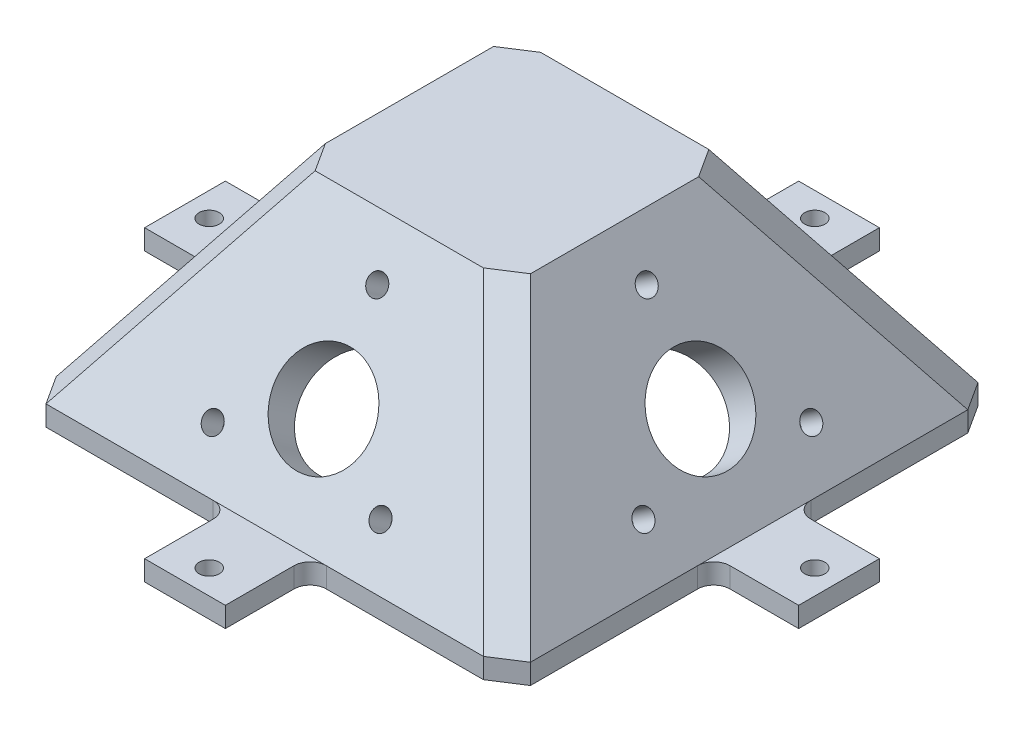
ISO-10303-21;
HEADER;
FILE_DESCRIPTION(('STEP AP214'),'2;1');
FILE_NAME('part.step','',(''),(''),'','','');
FILE_SCHEMA(('AUTOMOTIVE_DESIGN { 1 0 10303 214 1 1 1 1 }'));
ENDSEC;
DATA;
#1=APPLICATION_CONTEXT('core data for automotive mechanical design processes');
#2=APPLICATION_PROTOCOL_DEFINITION('international standard','automotive_design',2000,#1);
#3=PRODUCT_CONTEXT('',#1,'mechanical');
#4=PRODUCT('Part','Part','',(#3));
#5=PRODUCT_RELATED_PRODUCT_CATEGORY('part','',(#4));
#6=PRODUCT_DEFINITION_FORMATION('','',#4);
#7=PRODUCT_DEFINITION_CONTEXT('part definition',#1,'design');
#8=PRODUCT_DEFINITION('design','',#6,#7);
#9=PRODUCT_DEFINITION_SHAPE('','',#8);
#10=(LENGTH_UNIT() NAMED_UNIT(*) SI_UNIT(.MILLI.,.METRE.));
#11=(NAMED_UNIT(*) PLANE_ANGLE_UNIT() SI_UNIT($,.RADIAN.));
#12=(NAMED_UNIT(*) SI_UNIT($,.STERADIAN.) SOLID_ANGLE_UNIT());
#13=UNCERTAINTY_MEASURE_WITH_UNIT(LENGTH_MEASURE(1.E-05),#10,'distance_accuracy_value','');
#14=(GEOMETRIC_REPRESENTATION_CONTEXT(3) GLOBAL_UNCERTAINTY_ASSIGNED_CONTEXT((#13)) GLOBAL_UNIT_ASSIGNED_CONTEXT((#10,
#11,#12)) REPRESENTATION_CONTEXT('',''));
#15=CARTESIAN_POINT('',(0.,0.,0.));
#16=DIRECTION('',(0.,0.,1.));
#17=DIRECTION('',(1.,0.,0.));
#18=AXIS2_PLACEMENT_3D('',#15,#16,#17);
#19=CARTESIAN_POINT('',(6.99999999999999,-2.5,-32.));
#20=DIRECTION('',(0.,1.,0.));
#21=DIRECTION('',(0.,0.,1.));
#22=AXIS2_PLACEMENT_3D('',#19,#20,#21);
#23=PLANE('',#22);
#24=DIRECTION('',(1.,0.,0.));
#25=VECTOR('',#24,1.);
#26=CARTESIAN_POINT('',(-7.,-2.5,-30.));
#27=LINE('',#26,#25);
#28=CARTESIAN_POINT('',(-7.,-2.5,-30.));
#29=VERTEX_POINT('',#28);
#30=CARTESIAN_POINT('',(6.99999999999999,-2.5,-30.));
#31=VERTEX_POINT('',#30);
#32=EDGE_CURVE('P0_E116',#29,#31,#27,.T.);
#33=ORIENTED_EDGE('',*,*,#32,.F.);
#34=CARTESIAN_POINT('',(-7.,-2.5,-32.));
#35=DIRECTION('',(0.,1.,0.));
#36=DIRECTION('',(0.,0.,1.));
#37=AXIS2_PLACEMENT_3D('',#34,#35,#36);
#38=CIRCLE('',#37,2.);
#39=CARTESIAN_POINT('',(-5.,-2.5,-32.));
#40=VERTEX_POINT('',#39);
#41=EDGE_CURVE('P0_E121',#29,#40,#38,.T.);
#42=ORIENTED_EDGE('',*,*,#41,.T.);
#43=DIRECTION('',(0.,0.,1.));
#44=VECTOR('',#43,1.);
#45=CARTESIAN_POINT('',(-5.00000000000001,-2.5,-32.));
#46=LINE('',#45,#44);
#47=CARTESIAN_POINT('',(-5.00000000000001,-2.5,-40.5));
#48=VERTEX_POINT('',#47);
#49=EDGE_CURVE('P0_E87',#48,#40,#46,.T.);
#50=ORIENTED_EDGE('',*,*,#49,.F.);
#51=DIRECTION('',(-1.,0.,0.));
#52=VECTOR('',#51,1.);
#53=CARTESIAN_POINT('',(-5.00000000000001,-2.5,-40.5));
#54=LINE('',#53,#52);
#55=CARTESIAN_POINT('',(5.,-2.5,-40.5));
#56=VERTEX_POINT('',#55);
#57=EDGE_CURVE('P0_E83',#56,#48,#54,.T.);
#58=ORIENTED_EDGE('',*,*,#57,.F.);
#59=DIRECTION('',(0.,0.,-1.));
#60=VECTOR('',#59,1.);
#61=CARTESIAN_POINT('',(5.,-2.5,-32.));
#62=LINE('',#61,#60);
#63=CARTESIAN_POINT('',(5.,-2.5,-32.));
#64=VERTEX_POINT('',#63);
#65=EDGE_CURVE('P0_E66',#64,#56,#62,.T.);
#66=ORIENTED_EDGE('',*,*,#65,.F.);
#67=CARTESIAN_POINT('',(6.99999999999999,-2.5,-32.));
#68=DIRECTION('',(0.,1.,0.));
#69=DIRECTION('',(0.,0.,1.));
#70=AXIS2_PLACEMENT_3D('',#67,#68,#69);
#71=CIRCLE('',#70,2.);
#72=EDGE_CURVE('P0_E60',#64,#31,#71,.T.);
#73=ORIENTED_EDGE('',*,*,#72,.T.);
#74=EDGE_LOOP('',(#33,#42,#50,#58,#66,#73));
#75=FACE_BOUND('',#74,.T.);
#76=CARTESIAN_POINT('',(1.31542873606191E-13,-2.5,-37.5));
#77=DIRECTION('',(0.,1.,0.));
#78=DIRECTION('',(0.,0.,1.));
#79=AXIS2_PLACEMENT_3D('',#76,#77,#78);
#80=CIRCLE('',#79,1.25);
#81=CARTESIAN_POINT('',(1.31542873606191E-13,-2.5,-36.25));
#82=VERTEX_POINT('',#81);
#83=EDGE_CURVE('P0_E20',#82,#82,#80,.T.);
#84=ORIENTED_EDGE('',*,*,#83,.T.);
#85=EDGE_LOOP('',(#84));
#86=FACE_BOUND('',#85,.T.);
#87=ADVANCED_FACE('P0_F17',(#75,#86),#23,.F.);
#88=CARTESIAN_POINT('',(1.31542873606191E-13,0.,-37.5));
#89=DIRECTION('',(0.,1.,0.));
#90=DIRECTION('',(0.,0.,1.));
#91=AXIS2_PLACEMENT_3D('',#88,#89,#90);
#92=CYLINDRICAL_SURFACE('',#91,1.25);
#93=CARTESIAN_POINT('',(1.31542873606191E-13,0.,-37.5));
#94=DIRECTION('',(0.,1.,0.));
#95=DIRECTION('',(0.,0.,1.));
#96=AXIS2_PLACEMENT_3D('',#93,#94,#95);
#97=CIRCLE('',#96,1.25);
#98=CARTESIAN_POINT('',(1.31542873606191E-13,0.,-36.25));
#99=VERTEX_POINT('',#98);
#100=EDGE_CURVE('P0_E132',#99,#99,#97,.F.);
#101=ORIENTED_EDGE('',*,*,#100,.F.);
#102=EDGE_LOOP('',(#101));
#103=FACE_BOUND('',#102,.T.);
#104=ORIENTED_EDGE('',*,*,#83,.F.);
#105=EDGE_LOOP('',(#104));
#106=FACE_BOUND('',#105,.T.);
#107=ADVANCED_FACE('P0_F141',(#103,#106),#92,.F.);
#108=CARTESIAN_POINT('',(6.99999999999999,-2.5,-32.));
#109=DIRECTION('',(0.,1.,0.));
#110=DIRECTION('',(0.,0.,1.));
#111=AXIS2_PLACEMENT_3D('',#108,#109,#110);
#112=CYLINDRICAL_SURFACE('',#111,2.);
#113=DIRECTION('',(0.,1.,0.));
#114=VECTOR('',#113,1.);
#115=CARTESIAN_POINT('',(6.99999999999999,-2.5,-30.));
#116=LINE('',#115,#114);
#117=CARTESIAN_POINT('',(6.99999999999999,0.,-30.));
#118=VERTEX_POINT('',#117);
#119=EDGE_CURVE('P0_E119',#31,#118,#116,.T.);
#120=ORIENTED_EDGE('',*,*,#119,.F.);
#121=ORIENTED_EDGE('',*,*,#72,.F.);
#122=DIRECTION('',(0.,1.,0.));
#123=VECTOR('',#122,1.);
#124=CARTESIAN_POINT('',(5.,-2.5,-32.));
#125=LINE('',#124,#123);
#126=CARTESIAN_POINT('',(5.,0.,-32.));
#127=VERTEX_POINT('',#126);
#128=EDGE_CURVE('P0_E114',#127,#64,#125,.F.);
#129=ORIENTED_EDGE('',*,*,#128,.F.);
#130=CARTESIAN_POINT('',(6.99999999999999,0.,-32.));
#131=DIRECTION('',(0.,1.,0.));
#132=DIRECTION('',(0.,0.,1.));
#133=AXIS2_PLACEMENT_3D('',#130,#131,#132);
#134=CIRCLE('',#133,2.);
#135=EDGE_CURVE('P0_E103',#118,#127,#134,.F.);
#136=ORIENTED_EDGE('',*,*,#135,.F.);
#137=EDGE_LOOP('',(#120,#121,#129,#136));
#138=FACE_BOUND('',#137,.T.);
#139=ADVANCED_FACE('P0_F143',(#138),#112,.F.);
#140=CARTESIAN_POINT('',(5.,-2.5,-32.));
#141=DIRECTION('',(1.,0.,0.));
#142=DIRECTION('',(0.,0.,-1.));
#143=AXIS2_PLACEMENT_3D('',#140,#141,#142);
#144=PLANE('',#143);
#145=ORIENTED_EDGE('',*,*,#65,.T.);
#146=DIRECTION('',(0.,1.,0.));
#147=VECTOR('',#146,1.);
#148=CARTESIAN_POINT('',(5.,-2.5,-40.5));
#149=LINE('',#148,#147);
#150=CARTESIAN_POINT('',(5.,0.,-40.5));
#151=VERTEX_POINT('',#150);
#152=EDGE_CURVE('P0_E110',#151,#56,#149,.F.);
#153=ORIENTED_EDGE('',*,*,#152,.F.);
#154=DIRECTION('',(0.,0.,1.));
#155=VECTOR('',#154,1.);
#156=CARTESIAN_POINT('',(5.,0.,-32.));
#157=LINE('',#156,#155);
#158=EDGE_CURVE('P0_E101',#127,#151,#157,.F.);
#159=ORIENTED_EDGE('',*,*,#158,.F.);
#160=ORIENTED_EDGE('',*,*,#128,.T.);
#161=EDGE_LOOP('',(#145,#153,#159,#160));
#162=FACE_BOUND('',#161,.T.);
#163=ADVANCED_FACE('P0_F150',(#162),#144,.T.);
#164=CARTESIAN_POINT('',(-5.00000000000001,-2.5,-40.5));
#165=DIRECTION('',(0.,0.,-1.));
#166=DIRECTION('',(-1.,0.,0.));
#167=AXIS2_PLACEMENT_3D('',#164,#165,#166);
#168=PLANE('',#167);
#169=ORIENTED_EDGE('',*,*,#57,.T.);
#170=DIRECTION('',(0.,1.,0.));
#171=VECTOR('',#170,1.);
#172=CARTESIAN_POINT('',(-5.00000000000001,-2.5,-40.5));
#173=LINE('',#172,#171);
#174=CARTESIAN_POINT('',(-5.00000000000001,0.,-40.5));
#175=VERTEX_POINT('',#174);
#176=EDGE_CURVE('P0_E76',#175,#48,#173,.F.);
#177=ORIENTED_EDGE('',*,*,#176,.F.);
#178=DIRECTION('',(1.,0.,0.));
#179=VECTOR('',#178,1.);
#180=CARTESIAN_POINT('',(6.99999999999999,0.,-40.5));
#181=LINE('',#180,#179);
#182=EDGE_CURVE('P0_E81',#151,#175,#181,.F.);
#183=ORIENTED_EDGE('',*,*,#182,.F.);
#184=ORIENTED_EDGE('',*,*,#152,.T.);
#185=EDGE_LOOP('',(#169,#177,#183,#184));
#186=FACE_BOUND('',#185,.T.);
#187=ADVANCED_FACE('P0_F78',(#186),#168,.T.);
#188=CARTESIAN_POINT('',(-5.00000000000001,-2.5,-32.));
#189=DIRECTION('',(-1.,0.,0.));
#190=DIRECTION('',(0.,0.,1.));
#191=AXIS2_PLACEMENT_3D('',#188,#189,#190);
#192=PLANE('',#191);
#193=ORIENTED_EDGE('',*,*,#49,.T.);
#194=DIRECTION('',(0.,1.,0.));
#195=VECTOR('',#194,1.);
#196=CARTESIAN_POINT('',(-5.,-2.5,-32.));
#197=LINE('',#196,#195);
#198=CARTESIAN_POINT('',(-5.00000000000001,0.,-32.));
#199=VERTEX_POINT('',#198);
#200=EDGE_CURVE('P0_E93',#40,#199,#197,.T.);
#201=ORIENTED_EDGE('',*,*,#200,.T.);
#202=DIRECTION('',(0.,0.,1.));
#203=VECTOR('',#202,1.);
#204=CARTESIAN_POINT('',(-5.00000000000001,0.,-32.));
#205=LINE('',#204,#203);
#206=EDGE_CURVE('P0_E90',#175,#199,#205,.T.);
#207=ORIENTED_EDGE('',*,*,#206,.F.);
#208=ORIENTED_EDGE('',*,*,#176,.T.);
#209=EDGE_LOOP('',(#193,#201,#207,#208));
#210=FACE_BOUND('',#209,.T.);
#211=ADVANCED_FACE('P0_F91',(#210),#192,.T.);
#212=CARTESIAN_POINT('',(-7.,-2.5,-32.));
#213=DIRECTION('',(0.,1.,0.));
#214=DIRECTION('',(0.,0.,1.));
#215=AXIS2_PLACEMENT_3D('',#212,#213,#214);
#216=CYLINDRICAL_SURFACE('',#215,2.);
#217=ORIENTED_EDGE('',*,*,#200,.F.);
#218=ORIENTED_EDGE('',*,*,#41,.F.);
#219=DIRECTION('',(0.,1.,0.));
#220=VECTOR('',#219,1.);
#221=CARTESIAN_POINT('',(-7.,-2.5,-30.));
#222=LINE('',#221,#220);
#223=CARTESIAN_POINT('',(-7.,0.,-30.));
#224=VERTEX_POINT('',#223);
#225=EDGE_CURVE('P0_E35',#224,#29,#222,.F.);
#226=ORIENTED_EDGE('',*,*,#225,.F.);
#227=CARTESIAN_POINT('',(-7.,0.,-32.));
#228=DIRECTION('',(0.,1.,0.));
#229=DIRECTION('',(0.,0.,1.));
#230=AXIS2_PLACEMENT_3D('',#227,#228,#229);
#231=CIRCLE('',#230,2.);
#232=EDGE_CURVE('P0_E26',#199,#224,#231,.F.);
#233=ORIENTED_EDGE('',*,*,#232,.F.);
#234=EDGE_LOOP('',(#217,#218,#226,#233));
#235=FACE_BOUND('',#234,.T.);
#236=ADVANCED_FACE('P0_F159',(#235),#216,.F.);
#237=CARTESIAN_POINT('',(-7.,-2.5,-30.));
#238=DIRECTION('',(0.,0.,1.));
#239=DIRECTION('',(1.,0.,0.));
#240=AXIS2_PLACEMENT_3D('',#237,#238,#239);
#241=PLANE('',#240);
#242=ORIENTED_EDGE('',*,*,#32,.T.);
#243=ORIENTED_EDGE('',*,*,#119,.T.);
#244=DIRECTION('',(1.,0.,0.));
#245=VECTOR('',#244,1.);
#246=CARTESIAN_POINT('',(6.99999999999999,0.,-30.));
#247=LINE('',#246,#245);
#248=EDGE_CURVE('P0_E11',#224,#118,#247,.T.);
#249=ORIENTED_EDGE('',*,*,#248,.F.);
#250=ORIENTED_EDGE('',*,*,#225,.T.);
#251=EDGE_LOOP('',(#242,#243,#249,#250));
#252=FACE_BOUND('',#251,.T.);
#253=ADVANCED_FACE('P0_F154',(#252),#241,.T.);
#254=CARTESIAN_POINT('',(6.99999999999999,0.,-32.));
#255=DIRECTION('',(0.,1.,0.));
#256=DIRECTION('',(0.,0.,1.));
#257=AXIS2_PLACEMENT_3D('',#254,#255,#256);
#258=PLANE('',#257);
#259=ORIENTED_EDGE('',*,*,#232,.T.);
#260=ORIENTED_EDGE('',*,*,#248,.T.);
#261=ORIENTED_EDGE('',*,*,#135,.T.);
#262=ORIENTED_EDGE('',*,*,#158,.T.);
#263=ORIENTED_EDGE('',*,*,#182,.T.);
#264=ORIENTED_EDGE('',*,*,#206,.T.);
#265=EDGE_LOOP('',(#259,#260,#261,#262,#263,#264));
#266=FACE_BOUND('',#265,.T.);
#267=ORIENTED_EDGE('',*,*,#100,.T.);
#268=EDGE_LOOP('',(#267));
#269=FACE_BOUND('',#268,.T.);
#270=ADVANCED_FACE('P0_F97',(#266,#269),#258,.T.);
#271=CLOSED_SHELL('',(#87,#107,#139,#163,#187,#211,#236,#253,#270));
#272=MANIFOLD_SOLID_BREP('P0_B1',#271);
#273=CARTESIAN_POINT('',(0.,27.,0.));
#274=DIRECTION('',(0.,-0.707106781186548,0.707106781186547));
#275=DIRECTION('',(0.,-0.707106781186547,-0.707106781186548));
#276=AXIS2_PLACEMENT_3D('',#273,#274,#275);
#277=PLANE('',#276);
#278=CARTESIAN_POINT('',(0.,7.45332306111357,-19.5466769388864));
#279=DIRECTION('',(0.,-0.707106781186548,0.707106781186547));
#280=DIRECTION('',(0.,-0.707106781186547,-0.707106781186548));
#281=AXIS2_PLACEMENT_3D('',#278,#279,#280);
#282=ELLIPSE('',#281,6.11882341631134,6.);
#283=CARTESIAN_POINT('',(0.,3.12666153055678,-23.8733384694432));
#284=VERTEX_POINT('',#283);
#285=EDGE_CURVE('P1_E548',#284,#284,#282,.F.);
#286=ORIENTED_EDGE('',*,*,#285,.T.);
#287=EDGE_LOOP('',(#286));
#288=FACE_BOUND('',#287,.T.);
#289=CARTESIAN_POINT('',(-10.3923048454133,3.1266615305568,-23.8733384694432));
#290=DIRECTION('',(0.,-0.707106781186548,0.707106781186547));
#291=DIRECTION('',(0.,-0.707106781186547,-0.707106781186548));
#292=AXIS2_PLACEMENT_3D('',#289,#290,#291);
#293=ELLIPSE('',#292,1.27475487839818,1.24999999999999);
#294=CARTESIAN_POINT('',(-10.3923048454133,2.22527371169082,-24.7747262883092));
#295=VERTEX_POINT('',#294);
#296=EDGE_CURVE('P1_E545',#295,#295,#293,.F.);
#297=ORIENTED_EDGE('',*,*,#296,.T.);
#298=EDGE_LOOP('',(#297));
#299=FACE_BOUND('',#298,.T.);
#300=CARTESIAN_POINT('',(10.3923048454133,3.1266615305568,-23.8733384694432));
#301=DIRECTION('',(0.,-0.707106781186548,0.707106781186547));
#302=DIRECTION('',(0.,-0.707106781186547,-0.707106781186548));
#303=AXIS2_PLACEMENT_3D('',#300,#301,#302);
#304=ELLIPSE('',#303,1.27475487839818,1.24999999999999);
#305=CARTESIAN_POINT('',(10.3923048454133,2.22527371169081,-24.7747262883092));
#306=VERTEX_POINT('',#305);
#307=EDGE_CURVE('P1_E551',#306,#306,#304,.F.);
#308=ORIENTED_EDGE('',*,*,#307,.T.);
#309=EDGE_LOOP('',(#308));
#310=FACE_BOUND('',#309,.T.);
#311=DIRECTION('',(1.,0.,0.));
#312=VECTOR('',#311,1.);
#313=CARTESIAN_POINT('',(-10.,17.,-10.));
#314=LINE('',#313,#312);
#315=CARTESIAN_POINT('',(10.,17.,-10.));
#316=VERTEX_POINT('',#315);
#317=CARTESIAN_POINT('',(0.166518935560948,17.,-10.));
#318=VERTEX_POINT('',#317);
#319=EDGE_CURVE('P1_E357',#316,#318,#314,.F.);
#320=ORIENTED_EDGE('',*,*,#319,.T.);
#321=CARTESIAN_POINT('',(0.,16.1066461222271,-10.8933538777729));
#322=DIRECTION('',(0.,-0.707106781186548,0.707106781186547));
#323=DIRECTION('',(0.,-0.707106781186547,-0.707106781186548));
#324=AXIS2_PLACEMENT_3D('',#321,#322,#323);
#325=ELLIPSE('',#324,1.27475487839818,1.24999999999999);
#326=CARTESIAN_POINT('',(-0.166518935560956,17.,-10.));
#327=VERTEX_POINT('',#326);
#328=EDGE_CURVE('P1_E553',#318,#327,#325,.F.);
#329=ORIENTED_EDGE('',*,*,#328,.T.);
#330=DIRECTION('',(1.,0.,0.));
#331=VECTOR('',#330,1.);
#332=CARTESIAN_POINT('',(-10.,17.,-10.));
#333=LINE('',#332,#331);
#334=CARTESIAN_POINT('',(-10.,17.,-10.));
#335=VERTEX_POINT('',#334);
#336=EDGE_CURVE('P1_E352',#327,#335,#333,.F.);
#337=ORIENTED_EDGE('',*,*,#336,.T.);
#338=DIRECTION('',(0.577350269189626,0.577350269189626,0.577350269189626));
#339=VECTOR('',#338,1.);
#340=CARTESIAN_POINT('',(-27.,0.,-27.));
#341=LINE('',#340,#339);
#342=CARTESIAN_POINT('',(-27.,0.,-27.));
#343=VERTEX_POINT('',#342);
#344=EDGE_CURVE('P1_E361',#343,#335,#341,.T.);
#345=ORIENTED_EDGE('',*,*,#344,.F.);
#346=DIRECTION('',(1.,0.,0.));
#347=VECTOR('',#346,1.);
#348=CARTESIAN_POINT('',(-27.,0.,-27.));
#349=LINE('',#348,#347);
#350=CARTESIAN_POINT('',(27.,0.,-27.));
#351=VERTEX_POINT('',#350);
#352=EDGE_CURVE('P1_E385',#351,#343,#349,.F.);
#353=ORIENTED_EDGE('',*,*,#352,.F.);
#354=DIRECTION('',(0.577350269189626,-0.577350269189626,-0.577350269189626));
#355=VECTOR('',#354,1.);
#356=CARTESIAN_POINT('',(10.,17.,-10.));
#357=LINE('',#356,#355);
#358=EDGE_CURVE('P1_E397',#316,#351,#357,.T.);
#359=ORIENTED_EDGE('',*,*,#358,.F.);
#360=EDGE_LOOP('',(#320,#329,#337,#345,#353,#359));
#361=FACE_BOUND('',#360,.T.);
#362=ADVANCED_FACE('P1_F17',(#288,#299,#310,#361),#277,.T.);
#363=CARTESIAN_POINT('',(0.,27.,0.));
#364=DIRECTION('',(-0.707106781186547,-0.707106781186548,0.));
#365=DIRECTION('',(0.707106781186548,-0.707106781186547,0.));
#366=AXIS2_PLACEMENT_3D('',#363,#364,#365);
#367=PLANE('',#366);
#368=CARTESIAN_POINT('',(19.5466769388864,7.45332306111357,1.98752691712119E-13));
#369=DIRECTION('',(-0.707106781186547,-0.707106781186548,0.));
#370=DIRECTION('',(0.707106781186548,-0.707106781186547,0.));
#371=AXIS2_PLACEMENT_3D('',#368,#369,#370);
#372=ELLIPSE('',#371,6.11882341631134,6.);
#373=CARTESIAN_POINT('',(23.8733384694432,3.12666153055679,4.67966933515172E-13));
#374=VERTEX_POINT('',#373);
#375=EDGE_CURVE('P1_E524',#374,#374,#372,.F.);
#376=ORIENTED_EDGE('',*,*,#375,.T.);
#377=EDGE_LOOP('',(#376));
#378=FACE_BOUND('',#377,.T.);
#379=CARTESIAN_POINT('',(23.8733384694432,3.12666153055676,-10.392304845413));
#380=DIRECTION('',(-0.707106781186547,-0.707106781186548,0.));
#381=DIRECTION('',(0.707106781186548,-0.707106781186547,0.));
#382=AXIS2_PLACEMENT_3D('',#379,#380,#381);
#383=ELLIPSE('',#382,1.27475487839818,1.24999999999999);
#384=CARTESIAN_POINT('',(24.7747262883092,2.22527371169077,-10.392304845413));
#385=VERTEX_POINT('',#384);
#386=EDGE_CURVE('P1_E527',#385,#385,#383,.F.);
#387=ORIENTED_EDGE('',*,*,#386,.T.);
#388=EDGE_LOOP('',(#387));
#389=FACE_BOUND('',#388,.T.);
#390=CARTESIAN_POINT('',(23.8733384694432,3.12666153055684,10.3923048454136));
#391=DIRECTION('',(-0.707106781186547,-0.707106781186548,0.));
#392=DIRECTION('',(0.707106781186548,-0.707106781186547,0.));
#393=AXIS2_PLACEMENT_3D('',#390,#391,#392);
#394=ELLIPSE('',#393,1.27475487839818,1.24999999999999);
#395=CARTESIAN_POINT('',(24.7747262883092,2.22527371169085,10.3923048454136));
#396=VERTEX_POINT('',#395);
#397=EDGE_CURVE('P1_E521',#396,#396,#394,.F.);
#398=ORIENTED_EDGE('',*,*,#397,.T.);
#399=EDGE_LOOP('',(#398));
#400=FACE_BOUND('',#399,.T.);
#401=DIRECTION('',(0.,0.,1.));
#402=VECTOR('',#401,1.);
#403=CARTESIAN_POINT('',(9.99999999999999,17.,-10.));
#404=LINE('',#403,#402);
#405=CARTESIAN_POINT('',(9.99999999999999,17.,10.));
#406=VERTEX_POINT('',#405);
#407=CARTESIAN_POINT('',(9.99999999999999,17.,0.166518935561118));
#408=VERTEX_POINT('',#407);
#409=EDGE_CURVE('P1_E340',#406,#408,#404,.F.);
#410=ORIENTED_EDGE('',*,*,#409,.T.);
#411=CARTESIAN_POINT('',(10.8933538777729,16.1066461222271,1.71186205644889E-13));
#412=DIRECTION('',(-0.707106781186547,-0.707106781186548,0.));
#413=DIRECTION('',(0.707106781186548,-0.707106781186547,0.));
#414=AXIS2_PLACEMENT_3D('',#411,#412,#413);
#415=ELLIPSE('',#414,1.27475487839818,1.24999999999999);
#416=CARTESIAN_POINT('',(10.,17.,-0.166518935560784));
#417=VERTEX_POINT('',#416);
#418=EDGE_CURVE('P1_E515',#408,#417,#415,.F.);
#419=ORIENTED_EDGE('',*,*,#418,.T.);
#420=DIRECTION('',(0.,0.,1.));
#421=VECTOR('',#420,1.);
#422=CARTESIAN_POINT('',(10.,17.,-10.));
#423=LINE('',#422,#421);
#424=EDGE_CURVE('P1_E337',#417,#316,#423,.F.);
#425=ORIENTED_EDGE('',*,*,#424,.T.);
#426=ORIENTED_EDGE('',*,*,#358,.T.);
#427=DIRECTION('',(0.,0.,1.));
#428=VECTOR('',#427,1.);
#429=CARTESIAN_POINT('',(27.,0.,-27.));
#430=LINE('',#429,#428);
#431=CARTESIAN_POINT('',(27.,0.,27.));
#432=VERTEX_POINT('',#431);
#433=EDGE_CURVE('P1_E372',#432,#351,#430,.F.);
#434=ORIENTED_EDGE('',*,*,#433,.F.);
#435=DIRECTION('',(0.577350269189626,-0.577350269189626,0.577350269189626));
#436=VECTOR('',#435,1.);
#437=CARTESIAN_POINT('',(9.99999999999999,17.,10.));
#438=LINE('',#437,#436);
#439=EDGE_CURVE('P1_E241',#406,#432,#438,.T.);
#440=ORIENTED_EDGE('',*,*,#439,.F.);
#441=EDGE_LOOP('',(#410,#419,#425,#426,#434,#440));
#442=FACE_BOUND('',#441,.T.);
#443=ADVANCED_FACE('P1_F846',(#378,#389,#400,#442),#367,.T.);
#444=CARTESIAN_POINT('',(0.,27.,0.));
#445=DIRECTION('',(0.707106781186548,-0.707106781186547,0.));
#446=DIRECTION('',(0.707106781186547,0.707106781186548,0.));
#447=AXIS2_PLACEMENT_3D('',#444,#445,#446);
#448=PLANE('',#447);
#449=CARTESIAN_POINT('',(-19.5466769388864,7.45332306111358,0.));
#450=DIRECTION('',(0.707106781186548,-0.707106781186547,0.));
#451=DIRECTION('',(-0.707106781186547,-0.707106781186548,0.));
#452=AXIS2_PLACEMENT_3D('',#449,#450,#451);
#453=ELLIPSE('',#452,6.11882341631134,6.);
#454=CARTESIAN_POINT('',(-23.8733384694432,3.12666153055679,-1.48394387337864E-13));
#455=VERTEX_POINT('',#454);
#456=EDGE_CURVE('P1_E530',#455,#455,#453,.F.);
#457=ORIENTED_EDGE('',*,*,#456,.T.);
#458=EDGE_LOOP('',(#457));
#459=FACE_BOUND('',#458,.T.);
#460=CARTESIAN_POINT('',(-23.8733384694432,3.12666153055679,10.3923048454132));
#461=DIRECTION('',(0.707106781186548,-0.707106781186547,0.));
#462=DIRECTION('',(-0.707106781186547,-0.707106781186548,0.));
#463=AXIS2_PLACEMENT_3D('',#460,#461,#462);
#464=ELLIPSE('',#463,1.27475487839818,1.24999999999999);
#465=CARTESIAN_POINT('',(-24.7747262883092,2.2252737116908,10.3923048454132));
#466=VERTEX_POINT('',#465);
#467=EDGE_CURVE('P1_E533',#466,#466,#464,.F.);
#468=ORIENTED_EDGE('',*,*,#467,.T.);
#469=EDGE_LOOP('',(#468));
#470=FACE_BOUND('',#469,.T.);
#471=CARTESIAN_POINT('',(-23.8733384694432,3.12666153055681,-10.3923048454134));
#472=DIRECTION('',(0.707106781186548,-0.707106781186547,0.));
#473=DIRECTION('',(-0.707106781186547,-0.707106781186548,0.));
#474=AXIS2_PLACEMENT_3D('',#471,#472,#473);
#475=ELLIPSE('',#474,1.27475487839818,1.24999999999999);
#476=CARTESIAN_POINT('',(-24.7747262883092,2.22527371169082,-10.3923048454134));
#477=VERTEX_POINT('',#476);
#478=EDGE_CURVE('P1_E536',#477,#477,#475,.F.);
#479=ORIENTED_EDGE('',*,*,#478,.T.);
#480=EDGE_LOOP('',(#479));
#481=FACE_BOUND('',#480,.T.);
#482=DIRECTION('',(0.,0.,1.));
#483=VECTOR('',#482,1.);
#484=CARTESIAN_POINT('',(-10.,17.,-10.));
#485=LINE('',#484,#483);
#486=CARTESIAN_POINT('',(-10.,17.,-0.166518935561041));
#487=VERTEX_POINT('',#486);
#488=EDGE_CURVE('P1_E347',#335,#487,#485,.T.);
#489=ORIENTED_EDGE('',*,*,#488,.T.);
#490=CARTESIAN_POINT('',(-10.8933538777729,16.1066461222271,0.));
#491=DIRECTION('',(0.707106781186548,-0.707106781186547,0.));
#492=DIRECTION('',(-0.707106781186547,-0.707106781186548,0.));
#493=AXIS2_PLACEMENT_3D('',#490,#491,#492);
#494=ELLIPSE('',#493,1.27475487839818,1.24999999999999);
#495=CARTESIAN_POINT('',(-10.,17.,0.166518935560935));
#496=VERTEX_POINT('',#495);
#497=EDGE_CURVE('P1_E542',#487,#496,#494,.F.);
#498=ORIENTED_EDGE('',*,*,#497,.T.);
#499=DIRECTION('',(0.,0.,1.));
#500=VECTOR('',#499,1.);
#501=CARTESIAN_POINT('',(-10.,17.,-10.));
#502=LINE('',#501,#500);
#503=CARTESIAN_POINT('',(-10.,17.,10.));
#504=VERTEX_POINT('',#503);
#505=EDGE_CURVE('P1_E221',#496,#504,#502,.T.);
#506=ORIENTED_EDGE('',*,*,#505,.T.);
#507=DIRECTION('',(0.577350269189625,0.577350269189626,-0.577350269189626));
#508=VECTOR('',#507,1.);
#509=CARTESIAN_POINT('',(-27.,0.,27.));
#510=LINE('',#509,#508);
#511=CARTESIAN_POINT('',(-27.,0.,27.));
#512=VERTEX_POINT('',#511);
#513=EDGE_CURVE('P1_E226',#512,#504,#510,.T.);
#514=ORIENTED_EDGE('',*,*,#513,.F.);
#515=DIRECTION('',(0.,0.,-1.));
#516=VECTOR('',#515,1.);
#517=CARTESIAN_POINT('',(-27.,0.,27.));
#518=LINE('',#517,#516);
#519=EDGE_CURVE('P1_E248',#343,#512,#518,.F.);
#520=ORIENTED_EDGE('',*,*,#519,.F.);
#521=ORIENTED_EDGE('',*,*,#344,.T.);
#522=EDGE_LOOP('',(#489,#498,#506,#514,#520,#521));
#523=FACE_BOUND('',#522,.T.);
#524=ADVANCED_FACE('P1_F844',(#459,#470,#481,#523),#448,.T.);
#525=CARTESIAN_POINT('',(-10.,17.,-10.));
#526=DIRECTION('',(0.,1.,0.));
#527=DIRECTION('',(0.,0.,1.));
#528=AXIS2_PLACEMENT_3D('',#525,#526,#527);
#529=PLANE('',#528);
#530=ORIENTED_EDGE('',*,*,#424,.F.);
#531=CARTESIAN_POINT('',(12.2333846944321,17.,1.71186205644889E-13));
#532=DIRECTION('',(0.,1.,0.));
#533=DIRECTION('',(1.,0.,0.));
#534=AXIS2_PLACEMENT_3D('',#531,#532,#533);
#535=ELLIPSE('',#534,2.25346954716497,1.24999999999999);
#536=EDGE_CURVE('P1_E518',#417,#408,#535,.T.);
#537=ORIENTED_EDGE('',*,*,#536,.T.);
#538=ORIENTED_EDGE('',*,*,#409,.F.);
#539=DIRECTION('',(1.,0.,0.));
#540=VECTOR('',#539,1.);
#541=CARTESIAN_POINT('',(0.,17.,10.));
#542=LINE('',#541,#540);
#543=CARTESIAN_POINT('',(0.166518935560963,17.,10.));
#544=VERTEX_POINT('',#543);
#545=EDGE_CURVE('P1_E239',#544,#406,#542,.T.);
#546=ORIENTED_EDGE('',*,*,#545,.F.);
#547=CARTESIAN_POINT('',(0.166518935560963,17.,10.));
#548=CARTESIAN_POINT('',(0.159628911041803,17.0000000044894,9.99833034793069));
#549=CARTESIAN_POINT('',(0.152714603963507,17.0000000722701,9.99676057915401));
#550=CARTESIAN_POINT('',(0.138874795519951,17.0000002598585,9.99383116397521));
#551=CARTESIAN_POINT('',(0.131949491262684,17.0000003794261,9.99247058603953));
#552=CARTESIAN_POINT('',(0.118089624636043,17.0000005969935,9.98995957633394));
#553=CARTESIAN_POINT('',(0.111155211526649,17.0000006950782,9.98880832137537));
#554=CARTESIAN_POINT('',(0.0972791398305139,17.0000008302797,9.98671585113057));
#555=CARTESIAN_POINT('',(0.0903375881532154,17.000000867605,9.98577392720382));
#556=CARTESIAN_POINT('',(0.076449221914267,17.0000008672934,9.98410001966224));
#557=CARTESIAN_POINT('',(0.0695024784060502,17.0000008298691,9.98336744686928));
#558=CARTESIAN_POINT('',(0.0556057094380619,17.0000006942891,9.98211210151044));
#559=CARTESIAN_POINT('',(0.0486557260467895,17.0000005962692,9.98158886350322));
#560=CARTESIAN_POINT('',(0.0347544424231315,17.0000003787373,9.98075206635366));
#561=CARTESIAN_POINT('',(0.0278031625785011,17.0000002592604,9.98043816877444));
#562=CARTESIAN_POINT('',(0.0139012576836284,17.0000000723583,9.98001976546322));
#563=CARTESIAN_POINT('',(0.00695063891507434,17.0000000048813,9.97991505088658));
#564=CARTESIAN_POINT('',(0.,17.,9.97991514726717));
#565=B_SPLINE_CURVE_WITH_KNOTS('',3,(#547,#548,#549,#550,#551,#552,#553,#554,#555,#556,#557,
#558,#559,#560,#561,#562,#563,#564),.UNSPECIFIED.,.F.,.F.,(4,2,2,2,2,2,2,2,4),(0.,
0.0212676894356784,0.0424377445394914,0.0635226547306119,0.0845350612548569,0.105487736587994,
0.126393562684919,0.147265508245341,0.168116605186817),.UNSPECIFIED.);
#566=CARTESIAN_POINT('',(0.,17.,9.97991514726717));
#567=VERTEX_POINT('',#566);
#568=EDGE_CURVE('P1_E208',#567,#544,#565,.F.);
#569=ORIENTED_EDGE('',*,*,#568,.F.);
#570=CARTESIAN_POINT('',(0.,17.,9.97991514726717));
#571=CARTESIAN_POINT('',(-0.00695063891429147,17.0000000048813,9.97991505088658));
#572=CARTESIAN_POINT('',(-0.0139012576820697,17.0000000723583,9.98001976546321));
#573=CARTESIAN_POINT('',(-0.0278031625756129,17.0000002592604,9.98043816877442));
#574=CARTESIAN_POINT('',(-0.0347544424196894,17.0000003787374,9.98075206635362));
#575=CARTESIAN_POINT('',(-0.0486557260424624,17.0000005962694,9.98158886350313));
#576=CARTESIAN_POINT('',(-0.0556057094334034,17.0000006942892,9.98211210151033));
#577=CARTESIAN_POINT('',(-0.0695024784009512,17.0000008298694,9.98336744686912));
#578=CARTESIAN_POINT('',(-0.0764492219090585,17.0000008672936,9.98410001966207));
#579=CARTESIAN_POINT('',(-0.0903375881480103,17.0000008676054,9.98577392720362));
#580=CARTESIAN_POINT('',(-0.0972791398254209,17.00000083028,9.98671585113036));
#581=CARTESIAN_POINT('',(-0.111155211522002,17.0000006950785,9.98880832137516));
#582=CARTESIAN_POINT('',(-0.118089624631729,17.0000005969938,9.98995957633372));
#583=CARTESIAN_POINT('',(-0.131949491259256,17.0000003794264,9.99247058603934));
#584=CARTESIAN_POINT('',(-0.138874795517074,17.0000002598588,9.99383116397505));
#585=CARTESIAN_POINT('',(-0.152714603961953,17.0000000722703,9.99676057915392));
#586=CARTESIAN_POINT('',(-0.159628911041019,17.0000000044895,9.99833034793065));
#587=CARTESIAN_POINT('',(-0.166518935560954,17.,10.));
#588=B_SPLINE_CURVE_WITH_KNOTS('',3,(#570,#571,#572,#573,#574,#575,#576,#577,#578,#579,#580,
#581,#582,#583,#584,#585,#586,#587),.UNSPECIFIED.,.F.,.F.,(4,2,2,2,2,2,2,2,4),(0.,
0.0208510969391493,0.0417230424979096,0.0626288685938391,0.0835815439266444,0.10459395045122,
0.125678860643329,0.146848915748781,0.168116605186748),.UNSPECIFIED.);
#589=CARTESIAN_POINT('',(-0.166518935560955,17.,10.));
#590=VERTEX_POINT('',#589);
#591=EDGE_CURVE('P1_E206',#590,#567,#588,.F.);
#592=ORIENTED_EDGE('',*,*,#591,.F.);
#593=DIRECTION('',(1.,0.,0.));
#594=VECTOR('',#593,1.);
#595=CARTESIAN_POINT('',(0.,17.,10.));
#596=LINE('',#595,#594);
#597=EDGE_CURVE('P1_E220',#504,#590,#596,.T.);
#598=ORIENTED_EDGE('',*,*,#597,.F.);
#599=ORIENTED_EDGE('',*,*,#505,.F.);
#600=CARTESIAN_POINT('',(-12.2333846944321,17.,0.));
#601=DIRECTION('',(0.,1.,0.));
#602=DIRECTION('',(-1.,0.,0.));
#603=AXIS2_PLACEMENT_3D('',#600,#601,#602);
#604=ELLIPSE('',#603,2.25346954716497,1.24999999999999);
#605=EDGE_CURVE('P1_E539',#496,#487,#604,.T.);
#606=ORIENTED_EDGE('',*,*,#605,.T.);
#607=ORIENTED_EDGE('',*,*,#488,.F.);
#608=ORIENTED_EDGE('',*,*,#336,.F.);
#609=CARTESIAN_POINT('',(0.,17.,-12.2333846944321));
#610=DIRECTION('',(0.,1.,0.));
#611=DIRECTION('',(0.,0.,-1.));
#612=AXIS2_PLACEMENT_3D('',#609,#610,#611);
#613=ELLIPSE('',#612,2.25346954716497,1.24999999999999);
#614=EDGE_CURVE('P1_E20',#327,#318,#613,.T.);
#615=ORIENTED_EDGE('',*,*,#614,.T.);
#616=ORIENTED_EDGE('',*,*,#319,.F.);
#617=EDGE_LOOP('',(#530,#537,#538,#546,#569,#592,#598,#599,#606,#607,#608,#615,#616));
#618=FACE_BOUND('',#617,.T.);
#619=ADVANCED_FACE('P1_F219',(#618),#529,.F.);
#620=CARTESIAN_POINT('',(0.,19.9692070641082,-16.6871952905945));
#621=DIRECTION('',(0.,0.554700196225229,-0.832050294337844));
#622=DIRECTION('',(0.,0.832050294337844,0.554700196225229));
#623=AXIS2_PLACEMENT_3D('',#620,#621,#622);
#624=CYLINDRICAL_SURFACE('',#623,1.24999999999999);
#625=ORIENTED_EDGE('',*,*,#614,.F.);
#626=ORIENTED_EDGE('',*,*,#328,.F.);
#627=EDGE_LOOP('',(#625,#626));
#628=FACE_BOUND('',#627,.T.);
#629=CARTESIAN_POINT('',(0.,19.9692070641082,-16.6871952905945));
#630=DIRECTION('',(0.,0.554700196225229,-0.832050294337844));
#631=DIRECTION('',(0.,0.832050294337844,0.554700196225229));
#632=AXIS2_PLACEMENT_3D('',#629,#630,#631);
#633=CIRCLE('',#632,1.24999999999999);
#634=CARTESIAN_POINT('',(0.,21.0092699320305,-15.993820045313));
#635=VERTEX_POINT('',#634);
#636=EDGE_CURVE('P1_E231',#635,#635,#633,.T.);
#637=ORIENTED_EDGE('',*,*,#636,.T.);
#638=EDGE_LOOP('',(#637));
#639=FACE_BOUND('',#638,.T.);
#640=ADVANCED_FACE('P1_F562',(#628,#639),#624,.F.);
#641=CARTESIAN_POINT('',(10.3923048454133,4.99230176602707,-26.6717988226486));
#642=DIRECTION('',(0.,0.554700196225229,-0.832050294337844));
#643=DIRECTION('',(0.,0.832050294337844,0.554700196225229));
#644=AXIS2_PLACEMENT_3D('',#641,#642,#643);
#645=CYLINDRICAL_SURFACE('',#644,1.24999999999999);
#646=ORIENTED_EDGE('',*,*,#307,.F.);
#647=EDGE_LOOP('',(#646));
#648=FACE_BOUND('',#647,.T.);
#649=CARTESIAN_POINT('',(10.3923048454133,4.99230176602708,-26.6717988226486));
#650=DIRECTION('',(0.,0.554700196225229,-0.832050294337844));
#651=DIRECTION('',(0.,0.832050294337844,0.554700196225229));
#652=AXIS2_PLACEMENT_3D('',#649,#650,#651);
#653=CIRCLE('',#652,1.24999999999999);
#654=CARTESIAN_POINT('',(10.3923048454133,6.03236463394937,-25.9784235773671));
#655=VERTEX_POINT('',#654);
#656=EDGE_CURVE('P1_E504',#655,#655,#653,.T.);
#657=ORIENTED_EDGE('',*,*,#656,.T.);
#658=EDGE_LOOP('',(#657));
#659=FACE_BOUND('',#658,.T.);
#660=ADVANCED_FACE('P1_F565',(#648,#659),#645,.F.);
#661=CARTESIAN_POINT('',(0.,-17.7077810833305,18.1949792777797));
#662=DIRECTION('',(0.,0.554700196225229,-0.832050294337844));
#663=DIRECTION('',(0.,0.832050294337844,0.554700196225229));
#664=AXIS2_PLACEMENT_3D('',#661,#662,#663);
#665=CYLINDRICAL_SURFACE('',#664,6.);
#666=ORIENTED_EDGE('',*,*,#285,.F.);
#667=EDGE_LOOP('',(#666));
#668=FACE_BOUND('',#667,.T.);
#669=CARTESIAN_POINT('',(0.,9.98460353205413,-23.3435976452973));
#670=DIRECTION('',(0.,0.554700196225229,-0.832050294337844));
#671=DIRECTION('',(0.,0.832050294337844,0.554700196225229));
#672=AXIS2_PLACEMENT_3D('',#669,#670,#671);
#673=CIRCLE('',#672,6.);
#674=CARTESIAN_POINT('',(0.,14.9769052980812,-20.0153964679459));
#675=VERTEX_POINT('',#674);
#676=EDGE_CURVE('P1_E500',#675,#675,#673,.T.);
#677=ORIENTED_EDGE('',*,*,#676,.T.);
#678=EDGE_LOOP('',(#677));
#679=FACE_BOUND('',#678,.T.);
#680=ADVANCED_FACE('P1_F834',(#668,#679),#665,.F.);
#681=CARTESIAN_POINT('',(-10.3923048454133,4.99230176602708,-26.6717988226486));
#682=DIRECTION('',(0.,0.554700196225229,-0.832050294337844));
#683=DIRECTION('',(0.,0.832050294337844,0.554700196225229));
#684=AXIS2_PLACEMENT_3D('',#681,#682,#683);
#685=CYLINDRICAL_SURFACE('',#684,1.24999999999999);
#686=ORIENTED_EDGE('',*,*,#296,.F.);
#687=EDGE_LOOP('',(#686));
#688=FACE_BOUND('',#687,.T.);
#689=CARTESIAN_POINT('',(-10.3923048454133,4.99230176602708,-26.6717988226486));
#690=DIRECTION('',(0.,0.554700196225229,-0.832050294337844));
#691=DIRECTION('',(0.,0.832050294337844,0.554700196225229));
#692=AXIS2_PLACEMENT_3D('',#689,#690,#691);
#693=CIRCLE('',#692,1.24999999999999);
#694=CARTESIAN_POINT('',(-10.3923048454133,6.03236463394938,-25.9784235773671));
#695=VERTEX_POINT('',#694);
#696=EDGE_CURVE('P1_E497',#695,#695,#693,.T.);
#697=ORIENTED_EDGE('',*,*,#696,.T.);
#698=EDGE_LOOP('',(#697));
#699=FACE_BOUND('',#698,.T.);
#700=ADVANCED_FACE('P1_F830',(#688,#699),#685,.F.);
#701=CARTESIAN_POINT('',(-16.6871952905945,19.9692070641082,0.));
#702=DIRECTION('',(-0.832050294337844,0.554700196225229,0.));
#703=DIRECTION('',(-0.554700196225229,-0.832050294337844,0.));
#704=AXIS2_PLACEMENT_3D('',#701,#702,#703);
#705=CYLINDRICAL_SURFACE('',#704,1.24999999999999);
#706=ORIENTED_EDGE('',*,*,#497,.F.);
#707=ORIENTED_EDGE('',*,*,#605,.F.);
#708=EDGE_LOOP('',(#706,#707));
#709=FACE_BOUND('',#708,.T.);
#710=CARTESIAN_POINT('',(-16.6871952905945,19.9692070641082,0.));
#711=DIRECTION('',(-0.832050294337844,0.554700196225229,0.));
#712=DIRECTION('',(-0.554700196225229,-0.832050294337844,0.));
#713=AXIS2_PLACEMENT_3D('',#710,#711,#712);
#714=CIRCLE('',#713,1.24999999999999);
#715=CARTESIAN_POINT('',(-17.380570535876,18.9291441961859,0.));
#716=VERTEX_POINT('',#715);
#717=EDGE_CURVE('P1_E425',#716,#716,#714,.T.);
#718=ORIENTED_EDGE('',*,*,#717,.T.);
#719=EDGE_LOOP('',(#718));
#720=FACE_BOUND('',#719,.T.);
#721=ADVANCED_FACE('P1_F826',(#709,#720),#705,.F.);
#722=CARTESIAN_POINT('',(-26.6717988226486,4.99230176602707,-10.3923048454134));
#723=DIRECTION('',(-0.832050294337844,0.554700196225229,0.));
#724=DIRECTION('',(-0.554700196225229,-0.832050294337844,0.));
#725=AXIS2_PLACEMENT_3D('',#722,#723,#724);
#726=CYLINDRICAL_SURFACE('',#725,1.24999999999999);
#727=ORIENTED_EDGE('',*,*,#478,.F.);
#728=EDGE_LOOP('',(#727));
#729=FACE_BOUND('',#728,.T.);
#730=CARTESIAN_POINT('',(-26.6717988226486,4.99230176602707,-10.3923048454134));
#731=DIRECTION('',(-0.832050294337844,0.554700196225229,0.));
#732=DIRECTION('',(-0.554700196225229,-0.832050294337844,0.));
#733=AXIS2_PLACEMENT_3D('',#730,#731,#732);
#734=CIRCLE('',#733,1.24999999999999);
#735=CARTESIAN_POINT('',(-27.3651740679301,3.95223889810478,-10.3923048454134));
#736=VERTEX_POINT('',#735);
#737=EDGE_CURVE('P1_E492',#736,#736,#734,.T.);
#738=ORIENTED_EDGE('',*,*,#737,.T.);
#739=EDGE_LOOP('',(#738));
#740=FACE_BOUND('',#739,.T.);
#741=ADVANCED_FACE('P1_F822',(#729,#740),#726,.F.);
#742=CARTESIAN_POINT('',(-26.6717988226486,4.99230176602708,10.3923048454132));
#743=DIRECTION('',(-0.832050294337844,0.554700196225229,0.));
#744=DIRECTION('',(-0.554700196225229,-0.832050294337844,0.));
#745=AXIS2_PLACEMENT_3D('',#742,#743,#744);
#746=CYLINDRICAL_SURFACE('',#745,1.24999999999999);
#747=ORIENTED_EDGE('',*,*,#467,.F.);
#748=EDGE_LOOP('',(#747));
#749=FACE_BOUND('',#748,.T.);
#750=CARTESIAN_POINT('',(-26.6717988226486,4.99230176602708,10.3923048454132));
#751=DIRECTION('',(-0.832050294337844,0.554700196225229,0.));
#752=DIRECTION('',(-0.554700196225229,-0.832050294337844,0.));
#753=AXIS2_PLACEMENT_3D('',#750,#751,#752);
#754=CIRCLE('',#753,1.24999999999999);
#755=CARTESIAN_POINT('',(-27.3651740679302,3.95223889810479,10.3923048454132));
#756=VERTEX_POINT('',#755);
#757=EDGE_CURVE('P1_E489',#756,#756,#754,.T.);
#758=ORIENTED_EDGE('',*,*,#757,.T.);
#759=EDGE_LOOP('',(#758));
#760=FACE_BOUND('',#759,.T.);
#761=ADVANCED_FACE('P1_F818',(#749,#760),#746,.F.);
#762=CARTESIAN_POINT('',(18.1949792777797,-17.7077810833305,0.));
#763=DIRECTION('',(-0.832050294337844,0.554700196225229,0.));
#764=DIRECTION('',(-0.554700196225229,-0.832050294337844,0.));
#765=AXIS2_PLACEMENT_3D('',#762,#763,#764);
#766=CYLINDRICAL_SURFACE('',#765,6.);
#767=ORIENTED_EDGE('',*,*,#456,.F.);
#768=EDGE_LOOP('',(#767));
#769=FACE_BOUND('',#768,.T.);
#770=CARTESIAN_POINT('',(-23.3435976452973,9.98460353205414,0.));
#771=DIRECTION('',(-0.832050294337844,0.554700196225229,0.));
#772=DIRECTION('',(-0.554700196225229,-0.832050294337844,0.));
#773=AXIS2_PLACEMENT_3D('',#770,#771,#772);
#774=CIRCLE('',#773,6.);
#775=CARTESIAN_POINT('',(-26.6717988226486,4.99230176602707,0.));
#776=VERTEX_POINT('',#775);
#777=EDGE_CURVE('P1_E314',#776,#776,#774,.T.);
#778=ORIENTED_EDGE('',*,*,#777,.T.);
#779=EDGE_LOOP('',(#778));
#780=FACE_BOUND('',#779,.T.);
#781=ADVANCED_FACE('P1_F815',(#769,#780),#766,.F.);
#782=CARTESIAN_POINT('',(-32.,0.,-6.99999999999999));
#783=DIRECTION('',(0.,1.,0.));
#784=DIRECTION('',(0.,0.,1.));
#785=AXIS2_PLACEMENT_3D('',#782,#783,#784);
#786=PLANE('',#785);
#787=CARTESIAN_POINT('',(-32.,0.,7.));
#788=DIRECTION('',(0.,1.,0.));
#789=DIRECTION('',(0.,0.,1.));
#790=AXIS2_PLACEMENT_3D('',#787,#788,#789);
#791=CIRCLE('',#790,2.);
#792=CARTESIAN_POINT('',(-32.,0.,5.));
#793=VERTEX_POINT('',#792);
#794=CARTESIAN_POINT('',(-30.,0.,7.));
#795=VERTEX_POINT('',#794);
#796=EDGE_CURVE('P1_E308',#793,#795,#791,.F.);
#797=ORIENTED_EDGE('',*,*,#796,.T.);
#798=DIRECTION('',(0.,0.,1.));
#799=VECTOR('',#798,1.);
#800=CARTESIAN_POINT('',(-30.,0.,30.));
#801=LINE('',#800,#799);
#802=CARTESIAN_POINT('',(-30.,0.,-7.));
#803=VERTEX_POINT('',#802);
#804=EDGE_CURVE('P1_E313',#795,#803,#801,.F.);
#805=ORIENTED_EDGE('',*,*,#804,.T.);
#806=CARTESIAN_POINT('',(-32.,0.,-6.99999999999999));
#807=DIRECTION('',(0.,1.,0.));
#808=DIRECTION('',(0.,0.,1.));
#809=AXIS2_PLACEMENT_3D('',#806,#807,#808);
#810=CIRCLE('',#809,2.);
#811=CARTESIAN_POINT('',(-32.,0.,-5.));
#812=VERTEX_POINT('',#811);
#813=EDGE_CURVE('P1_E256',#803,#812,#810,.F.);
#814=ORIENTED_EDGE('',*,*,#813,.T.);
#815=DIRECTION('',(-1.,0.,0.));
#816=VECTOR('',#815,1.);
#817=CARTESIAN_POINT('',(-32.,0.,-5.));
#818=LINE('',#817,#816);
#819=CARTESIAN_POINT('',(-40.5,0.,-5.));
#820=VERTEX_POINT('',#819);
#821=EDGE_CURVE('P1_E273',#820,#812,#818,.F.);
#822=ORIENTED_EDGE('',*,*,#821,.F.);
#823=DIRECTION('',(0.,0.,1.));
#824=VECTOR('',#823,1.);
#825=CARTESIAN_POINT('',(-40.5,0.,5.));
#826=LINE('',#825,#824);
#827=CARTESIAN_POINT('',(-40.5,0.,5.));
#828=VERTEX_POINT('',#827);
#829=EDGE_CURVE('P1_E285',#828,#820,#826,.F.);
#830=ORIENTED_EDGE('',*,*,#829,.F.);
#831=DIRECTION('',(1.,0.,0.));
#832=VECTOR('',#831,1.);
#833=CARTESIAN_POINT('',(-32.,0.,5.));
#834=LINE('',#833,#832);
#835=EDGE_CURVE('P1_E291',#793,#828,#834,.F.);
#836=ORIENTED_EDGE('',*,*,#835,.F.);
#837=EDGE_LOOP('',(#797,#805,#814,#822,#830,#836));
#838=FACE_BOUND('',#837,.T.);
#839=CARTESIAN_POINT('',(-37.5,0.,0.));
#840=DIRECTION('',(0.,1.,0.));
#841=DIRECTION('',(0.,0.,1.));
#842=AXIS2_PLACEMENT_3D('',#839,#840,#841);
#843=CIRCLE('',#842,1.25);
#844=CARTESIAN_POINT('',(-37.5,0.,1.25));
#845=VERTEX_POINT('',#844);
#846=EDGE_CURVE('P1_E309',#845,#845,#843,.F.);
#847=ORIENTED_EDGE('',*,*,#846,.T.);
#848=EDGE_LOOP('',(#847));
#849=FACE_BOUND('',#848,.T.);
#850=ADVANCED_FACE('P1_F697',(#838,#849),#786,.T.);
#851=CARTESIAN_POINT('',(26.6717988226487,4.99230176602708,-10.392304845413));
#852=DIRECTION('',(0.832050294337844,0.554700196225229,0.));
#853=DIRECTION('',(-0.554700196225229,0.832050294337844,0.));
#854=AXIS2_PLACEMENT_3D('',#851,#852,#853);
#855=CYLINDRICAL_SURFACE('',#854,1.24999999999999);
#856=ORIENTED_EDGE('',*,*,#386,.F.);
#857=EDGE_LOOP('',(#856));
#858=FACE_BOUND('',#857,.T.);
#859=CARTESIAN_POINT('',(26.6717988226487,4.99230176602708,-10.392304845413));
#860=DIRECTION('',(0.832050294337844,0.554700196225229,0.));
#861=DIRECTION('',(-0.554700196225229,0.832050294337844,0.));
#862=AXIS2_PLACEMENT_3D('',#859,#860,#861);
#863=CIRCLE('',#862,1.24999999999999);
#864=CARTESIAN_POINT('',(25.9784235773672,6.03236463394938,-10.392304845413));
#865=VERTEX_POINT('',#864);
#866=EDGE_CURVE('P1_E431',#865,#865,#863,.T.);
#867=ORIENTED_EDGE('',*,*,#866,.T.);
#868=EDGE_LOOP('',(#867));
#869=FACE_BOUND('',#868,.T.);
#870=ADVANCED_FACE('P1_F808',(#858,#869),#855,.F.);
#871=CARTESIAN_POINT('',(-18.1949792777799,-17.7077810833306,-1.90023039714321E-13));
#872=DIRECTION('',(0.832050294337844,0.554700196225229,0.));
#873=DIRECTION('',(-0.554700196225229,0.832050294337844,0.));
#874=AXIS2_PLACEMENT_3D('',#871,#872,#873);
#875=CYLINDRICAL_SURFACE('',#874,6.);
#876=ORIENTED_EDGE('',*,*,#375,.F.);
#877=EDGE_LOOP('',(#876));
#878=FACE_BOUND('',#877,.T.);
#879=CARTESIAN_POINT('',(23.3435976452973,9.98460353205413,2.37864664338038E-13));
#880=DIRECTION('',(0.832050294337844,0.554700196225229,0.));
#881=DIRECTION('',(-0.554700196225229,0.832050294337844,0.));
#882=AXIS2_PLACEMENT_3D('',#879,#880,#881);
#883=CIRCLE('',#882,6.);
#884=CARTESIAN_POINT('',(20.0153964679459,14.9769052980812,2.37864664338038E-13));
#885=VERTEX_POINT('',#884);
#886=EDGE_CURVE('P1_E481',#885,#885,#883,.T.);
#887=ORIENTED_EDGE('',*,*,#886,.T.);
#888=EDGE_LOOP('',(#887));
#889=FACE_BOUND('',#888,.T.);
#890=ADVANCED_FACE('P1_F804',(#878,#889),#875,.F.);
#891=CARTESIAN_POINT('',(26.6717988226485,4.99230176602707,10.3923048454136));
#892=DIRECTION('',(0.832050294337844,0.554700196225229,0.));
#893=DIRECTION('',(-0.554700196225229,0.832050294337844,0.));
#894=AXIS2_PLACEMENT_3D('',#891,#892,#893);
#895=CYLINDRICAL_SURFACE('',#894,1.24999999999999);
#896=ORIENTED_EDGE('',*,*,#397,.F.);
#897=EDGE_LOOP('',(#896));
#898=FACE_BOUND('',#897,.T.);
#899=CARTESIAN_POINT('',(26.6717988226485,4.99230176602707,10.3923048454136));
#900=DIRECTION('',(0.832050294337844,0.554700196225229,0.));
#901=DIRECTION('',(-0.554700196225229,0.832050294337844,0.));
#902=AXIS2_PLACEMENT_3D('',#899,#900,#901);
#903=CIRCLE('',#902,1.24999999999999);
#904=CARTESIAN_POINT('',(25.978423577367,6.03236463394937,10.3923048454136));
#905=VERTEX_POINT('',#904);
#906=EDGE_CURVE('P1_E477',#905,#905,#903,.T.);
#907=ORIENTED_EDGE('',*,*,#906,.T.);
#908=EDGE_LOOP('',(#907));
#909=FACE_BOUND('',#908,.T.);
#910=ADVANCED_FACE('P1_F800',(#898,#909),#895,.F.);
#911=CARTESIAN_POINT('',(16.6871952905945,19.9692070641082,1.71186205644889E-13));
#912=DIRECTION('',(0.832050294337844,0.554700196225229,0.));
#913=DIRECTION('',(-0.554700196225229,0.832050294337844,0.));
#914=AXIS2_PLACEMENT_3D('',#911,#912,#913);
#915=CYLINDRICAL_SURFACE('',#914,1.24999999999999);
#916=ORIENTED_EDGE('',*,*,#536,.F.);
#917=ORIENTED_EDGE('',*,*,#418,.F.);
#918=EDGE_LOOP('',(#916,#917));
#919=FACE_BOUND('',#918,.T.);
#920=CARTESIAN_POINT('',(16.6871952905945,19.9692070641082,1.71186205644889E-13));
#921=DIRECTION('',(0.832050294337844,0.554700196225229,0.));
#922=DIRECTION('',(-0.554700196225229,0.832050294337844,0.));
#923=AXIS2_PLACEMENT_3D('',#920,#921,#922);
#924=CIRCLE('',#923,1.24999999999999);
#925=CARTESIAN_POINT('',(15.993820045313,21.0092699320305,1.71186205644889E-13));
#926=VERTEX_POINT('',#925);
#927=EDGE_CURVE('P1_E474',#926,#926,#924,.T.);
#928=ORIENTED_EDGE('',*,*,#927,.T.);
#929=EDGE_LOOP('',(#928));
#930=FACE_BOUND('',#929,.T.);
#931=ADVANCED_FACE('P1_F796',(#919,#930),#915,.F.);
#932=CARTESIAN_POINT('',(-37.5,0.,0.));
#933=DIRECTION('',(0.,1.,0.));
#934=DIRECTION('',(0.,0.,1.));
#935=AXIS2_PLACEMENT_3D('',#932,#933,#934);
#936=CYLINDRICAL_SURFACE('',#935,1.25);
#937=CARTESIAN_POINT('',(-37.5,-2.5,0.));
#938=DIRECTION('',(0.,1.,0.));
#939=DIRECTION('',(0.,0.,1.));
#940=AXIS2_PLACEMENT_3D('',#937,#938,#939);
#941=CIRCLE('',#940,1.25);
#942=CARTESIAN_POINT('',(-37.5,-2.5,1.25));
#943=VERTEX_POINT('',#942);
#944=EDGE_CURVE('P1_E469',#943,#943,#941,.T.);
#945=ORIENTED_EDGE('',*,*,#944,.F.);
#946=EDGE_LOOP('',(#945));
#947=FACE_BOUND('',#946,.T.);
#948=ORIENTED_EDGE('',*,*,#846,.F.);
#949=EDGE_LOOP('',(#948));
#950=FACE_BOUND('',#949,.T.);
#951=ADVANCED_FACE('P1_F793',(#947,#950),#936,.F.);
#952=CARTESIAN_POINT('',(27.7129125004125,-2.5,-30.));
#953=DIRECTION('',(-0.840820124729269,0.,0.541314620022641));
#954=DIRECTION('',(0.541314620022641,0.,0.840820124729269));
#955=AXIS2_PLACEMENT_3D('',#952,#953,#954);
#956=PLANE('',#955);
#957=DIRECTION('',(0.,1.,0.));
#958=VECTOR('',#957,1.);
#959=CARTESIAN_POINT('',(30.,-2.5,-26.4474833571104));
#960=LINE('',#959,#958);
#961=CARTESIAN_POINT('',(30.,0.,-26.4474833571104));
#962=VERTEX_POINT('',#961);
#963=CARTESIAN_POINT('',(30.,-2.5,-26.4474833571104));
#964=VERTEX_POINT('',#963);
#965=EDGE_CURVE('P1_E305',#962,#964,#960,.F.);
#966=ORIENTED_EDGE('',*,*,#965,.T.);
#967=DIRECTION('',(0.541314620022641,0.,0.840820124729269));
#968=VECTOR('',#967,1.);
#969=CARTESIAN_POINT('',(27.7129125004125,-2.5,-30.));
#970=LINE('',#969,#968);
#971=CARTESIAN_POINT('',(27.7129125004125,-2.5,-30.));
#972=VERTEX_POINT('',#971);
#973=EDGE_CURVE('P1_E472',#972,#964,#970,.T.);
#974=ORIENTED_EDGE('',*,*,#973,.F.);
#975=DIRECTION('',(0.,1.,0.));
#976=VECTOR('',#975,1.);
#977=CARTESIAN_POINT('',(27.7129125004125,-2.5,-30.));
#978=LINE('',#977,#976);
#979=CARTESIAN_POINT('',(27.7129125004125,0.,-30.));
#980=VERTEX_POINT('',#979);
#981=EDGE_CURVE('P1_E245',#972,#980,#978,.T.);
#982=ORIENTED_EDGE('',*,*,#981,.T.);
#983=DIRECTION('',(0.541314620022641,0.,0.840820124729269));
#984=VECTOR('',#983,1.);
#985=CARTESIAN_POINT('',(27.7129125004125,0.,-30.));
#986=LINE('',#985,#984);
#987=EDGE_CURVE('P1_E228',#980,#962,#986,.T.);
#988=ORIENTED_EDGE('',*,*,#987,.T.);
#989=EDGE_LOOP('',(#966,#974,#982,#988));
#990=FACE_BOUND('',#989,.T.);
#991=ADVANCED_FACE('P1_F763',(#990),#956,.F.);
#992=CARTESIAN_POINT('',(30.,-2.5,27.7129125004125));
#993=DIRECTION('',(-1.,0.,0.));
#994=DIRECTION('',(0.,0.,1.));
#995=AXIS2_PLACEMENT_3D('',#992,#993,#994);
#996=PLANE('',#995);
#997=DIRECTION('',(0.,1.,0.));
#998=VECTOR('',#997,1.);
#999=CARTESIAN_POINT('',(30.,-2.5,27.7129125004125));
#1000=LINE('',#999,#998);
#1001=CARTESIAN_POINT('',(30.,0.,27.7129125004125));
#1002=VERTEX_POINT('',#1001);
#1003=CARTESIAN_POINT('',(30.,-2.5,27.7129125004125));
#1004=VERTEX_POINT('',#1003);
#1005=EDGE_CURVE('P1_E473',#1002,#1004,#1000,.F.);
#1006=ORIENTED_EDGE('',*,*,#1005,.T.);
#1007=DIRECTION('',(0.,0.,-1.));
#1008=VECTOR('',#1007,1.);
#1009=CARTESIAN_POINT('',(30.,-2.5,11.8427510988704));
#1010=LINE('',#1009,#1008);
#1011=EDGE_CURVE('P1_E658',#964,#1004,#1010,.F.);
#1012=ORIENTED_EDGE('',*,*,#1011,.F.);
#1013=ORIENTED_EDGE('',*,*,#965,.F.);
#1014=DIRECTION('',(0.,0.,1.));
#1015=VECTOR('',#1014,1.);
#1016=CARTESIAN_POINT('',(30.,0.,-30.));
#1017=LINE('',#1016,#1015);
#1018=EDGE_CURVE('P1_E480',#962,#1002,#1017,.T.);
#1019=ORIENTED_EDGE('',*,*,#1018,.T.);
#1020=EDGE_LOOP('',(#1006,#1012,#1013,#1019));
#1021=FACE_BOUND('',#1020,.T.);
#1022=ADVANCED_FACE('P1_F758',(#1021),#996,.F.);
#1023=CARTESIAN_POINT('',(-32.,-2.5,7.));
#1024=DIRECTION('',(0.,1.,0.));
#1025=DIRECTION('',(0.,0.,1.));
#1026=AXIS2_PLACEMENT_3D('',#1023,#1024,#1025);
#1027=CYLINDRICAL_SURFACE('',#1026,2.);
#1028=DIRECTION('',(0.,1.,0.));
#1029=VECTOR('',#1028,1.);
#1030=CARTESIAN_POINT('',(-32.,-2.5,5.));
#1031=LINE('',#1030,#1029);
#1032=CARTESIAN_POINT('',(-32.,-2.5,5.));
#1033=VERTEX_POINT('',#1032);
#1034=EDGE_CURVE('P1_E288',#1033,#793,#1031,.T.);
#1035=ORIENTED_EDGE('',*,*,#1034,.F.);
#1036=CARTESIAN_POINT('',(-32.,-2.5,7.));
#1037=DIRECTION('',(0.,1.,0.));
#1038=DIRECTION('',(0.,0.,1.));
#1039=AXIS2_PLACEMENT_3D('',#1036,#1037,#1038);
#1040=CIRCLE('',#1039,2.);
#1041=CARTESIAN_POINT('',(-30.,-2.5,7.));
#1042=VERTEX_POINT('',#1041);
#1043=EDGE_CURVE('P1_E466',#1042,#1033,#1040,.T.);
#1044=ORIENTED_EDGE('',*,*,#1043,.F.);
#1045=DIRECTION('',(0.,1.,0.));
#1046=VECTOR('',#1045,1.);
#1047=CARTESIAN_POINT('',(-30.,-2.5,7.00000000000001));
#1048=LINE('',#1047,#1046);
#1049=EDGE_CURVE('P1_E242',#1042,#795,#1048,.T.);
#1050=ORIENTED_EDGE('',*,*,#1049,.T.);
#1051=ORIENTED_EDGE('',*,*,#796,.F.);
#1052=EDGE_LOOP('',(#1035,#1044,#1050,#1051));
#1053=FACE_BOUND('',#1052,.T.);
#1054=ADVANCED_FACE('P1_F705',(#1053),#1027,.F.);
#1055=CARTESIAN_POINT('',(-32.,-2.5,5.));
#1056=DIRECTION('',(0.,0.,1.));
#1057=DIRECTION('',(1.,0.,0.));
#1058=AXIS2_PLACEMENT_3D('',#1055,#1056,#1057);
#1059=PLANE('',#1058);
#1060=DIRECTION('',(1.,0.,0.));
#1061=VECTOR('',#1060,1.);
#1062=CARTESIAN_POINT('',(54.651008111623,-2.5,5.));
#1063=LINE('',#1062,#1061);
#1064=CARTESIAN_POINT('',(-40.5,-2.5,5.));
#1065=VERTEX_POINT('',#1064);
#1066=EDGE_CURVE('P1_E279',#1033,#1065,#1063,.F.);
#1067=ORIENTED_EDGE('',*,*,#1066,.F.);
#1068=ORIENTED_EDGE('',*,*,#1034,.T.);
#1069=ORIENTED_EDGE('',*,*,#835,.T.);
#1070=DIRECTION('',(0.,1.,0.));
#1071=VECTOR('',#1070,1.);
#1072=CARTESIAN_POINT('',(-40.5,-2.5,5.));
#1073=LINE('',#1072,#1071);
#1074=EDGE_CURVE('P1_E282',#1065,#828,#1073,.T.);
#1075=ORIENTED_EDGE('',*,*,#1074,.F.);
#1076=EDGE_LOOP('',(#1067,#1068,#1069,#1075));
#1077=FACE_BOUND('',#1076,.T.);
#1078=ADVANCED_FACE('P1_F778',(#1077),#1059,.T.);
#1079=CARTESIAN_POINT('',(-40.5,-2.5,5.));
#1080=DIRECTION('',(-1.,0.,0.));
#1081=DIRECTION('',(0.,0.,1.));
#1082=AXIS2_PLACEMENT_3D('',#1079,#1080,#1081);
#1083=PLANE('',#1082);
#1084=DIRECTION('',(0.,0.,-1.));
#1085=VECTOR('',#1084,1.);
#1086=CARTESIAN_POINT('',(-40.5,-2.5,11.8427510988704));
#1087=LINE('',#1086,#1085);
#1088=CARTESIAN_POINT('',(-40.5,-2.5,-4.99999999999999));
#1089=VERTEX_POINT('',#1088);
#1090=EDGE_CURVE('P1_E276',#1065,#1089,#1087,.T.);
#1091=ORIENTED_EDGE('',*,*,#1090,.F.);
#1092=ORIENTED_EDGE('',*,*,#1074,.T.);
#1093=ORIENTED_EDGE('',*,*,#829,.T.);
#1094=DIRECTION('',(0.,1.,0.));
#1095=VECTOR('',#1094,1.);
#1096=CARTESIAN_POINT('',(-40.5,-2.5,-5.));
#1097=LINE('',#1096,#1095);
#1098=EDGE_CURVE('P1_E270',#1089,#820,#1097,.T.);
#1099=ORIENTED_EDGE('',*,*,#1098,.F.);
#1100=EDGE_LOOP('',(#1091,#1092,#1093,#1099));
#1101=FACE_BOUND('',#1100,.T.);
#1102=ADVANCED_FACE('P1_F774',(#1101),#1083,.T.);
#1103=CARTESIAN_POINT('',(-32.,-2.5,-5.));
#1104=DIRECTION('',(0.,0.,-1.));
#1105=DIRECTION('',(-1.,0.,0.));
#1106=AXIS2_PLACEMENT_3D('',#1103,#1104,#1105);
#1107=PLANE('',#1106);
#1108=DIRECTION('',(1.,0.,0.));
#1109=VECTOR('',#1108,1.);
#1110=CARTESIAN_POINT('',(54.651008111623,-2.5,-4.99999999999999));
#1111=LINE('',#1110,#1109);
#1112=CARTESIAN_POINT('',(-32.,-2.5,-4.99999999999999));
#1113=VERTEX_POINT('',#1112);
#1114=EDGE_CURVE('P1_E278',#1089,#1113,#1111,.T.);
#1115=ORIENTED_EDGE('',*,*,#1114,.F.);
#1116=ORIENTED_EDGE('',*,*,#1098,.T.);
#1117=ORIENTED_EDGE('',*,*,#821,.T.);
#1118=DIRECTION('',(0.,1.,0.));
#1119=VECTOR('',#1118,1.);
#1120=CARTESIAN_POINT('',(-32.,-2.5,-4.99999999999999));
#1121=LINE('',#1120,#1119);
#1122=EDGE_CURVE('P1_E267',#812,#1113,#1121,.F.);
#1123=ORIENTED_EDGE('',*,*,#1122,.T.);
#1124=EDGE_LOOP('',(#1115,#1116,#1117,#1123));
#1125=FACE_BOUND('',#1124,.T.);
#1126=ADVANCED_FACE('P1_F770',(#1125),#1107,.T.);
#1127=CARTESIAN_POINT('',(-32.,-2.5,-6.99999999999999));
#1128=DIRECTION('',(0.,1.,0.));
#1129=DIRECTION('',(0.,0.,1.));
#1130=AXIS2_PLACEMENT_3D('',#1127,#1128,#1129);
#1131=CYLINDRICAL_SURFACE('',#1130,2.);
#1132=DIRECTION('',(0.,1.,0.));
#1133=VECTOR('',#1132,1.);
#1134=CARTESIAN_POINT('',(-30.,-2.5,-7.));
#1135=LINE('',#1134,#1133);
#1136=CARTESIAN_POINT('',(-30.,-2.5,-6.99999999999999));
#1137=VERTEX_POINT('',#1136);
#1138=EDGE_CURVE('P1_E253',#803,#1137,#1135,.F.);
#1139=ORIENTED_EDGE('',*,*,#1138,.T.);
#1140=CARTESIAN_POINT('',(-32.,-2.5,-6.99999999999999));
#1141=DIRECTION('',(0.,1.,0.));
#1142=DIRECTION('',(0.,0.,1.));
#1143=AXIS2_PLACEMENT_3D('',#1140,#1141,#1142);
#1144=CIRCLE('',#1143,2.);
#1145=EDGE_CURVE('P1_E464',#1113,#1137,#1144,.T.);
#1146=ORIENTED_EDGE('',*,*,#1145,.F.);
#1147=ORIENTED_EDGE('',*,*,#1122,.F.);
#1148=ORIENTED_EDGE('',*,*,#813,.F.);
#1149=EDGE_LOOP('',(#1139,#1146,#1147,#1148));
#1150=FACE_BOUND('',#1149,.T.);
#1151=ADVANCED_FACE('P1_F768',(#1150),#1131,.F.);
#1152=CARTESIAN_POINT('',(-30.,-2.5,-27.7129125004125));
#1153=DIRECTION('',(1.,0.,0.));
#1154=DIRECTION('',(0.,0.,-1.));
#1155=AXIS2_PLACEMENT_3D('',#1152,#1153,#1154);
#1156=PLANE('',#1155);
#1157=ORIENTED_EDGE('',*,*,#1138,.F.);
#1158=DIRECTION('',(0.,0.,1.));
#1159=VECTOR('',#1158,1.);
#1160=CARTESIAN_POINT('',(-30.,0.,30.));
#1161=LINE('',#1160,#1159);
#1162=CARTESIAN_POINT('',(-30.,0.,-27.7129125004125));
#1163=VERTEX_POINT('',#1162);
#1164=EDGE_CURVE('P1_E319',#803,#1163,#1161,.F.);
#1165=ORIENTED_EDGE('',*,*,#1164,.T.);
#1166=DIRECTION('',(0.,1.,0.));
#1167=VECTOR('',#1166,1.);
#1168=CARTESIAN_POINT('',(-30.,-2.5,-27.7129125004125));
#1169=LINE('',#1168,#1167);
#1170=CARTESIAN_POINT('',(-30.,-2.5,-27.7129125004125));
#1171=VERTEX_POINT('',#1170);
#1172=EDGE_CURVE('P1_E252',#1163,#1171,#1169,.F.);
#1173=ORIENTED_EDGE('',*,*,#1172,.T.);
#1174=DIRECTION('',(0.,0.,-1.));
#1175=VECTOR('',#1174,1.);
#1176=CARTESIAN_POINT('',(-30.,-2.5,11.8427510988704));
#1177=LINE('',#1176,#1175);
#1178=EDGE_CURVE('P1_E264',#1137,#1171,#1177,.T.);
#1179=ORIENTED_EDGE('',*,*,#1178,.F.);
#1180=EDGE_LOOP('',(#1157,#1165,#1173,#1179));
#1181=FACE_BOUND('',#1180,.T.);
#1182=ADVANCED_FACE('P1_F690',(#1181),#1156,.F.);
#1183=CARTESIAN_POINT('',(-30.,-2.5,-27.7129125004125));
#1184=DIRECTION('',(0.541314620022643,0.,0.840820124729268));
#1185=DIRECTION('',(0.840820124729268,0.,-0.541314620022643));
#1186=AXIS2_PLACEMENT_3D('',#1183,#1184,#1185);
#1187=PLANE('',#1186);
#1188=DIRECTION('',(0.,1.,0.));
#1189=VECTOR('',#1188,1.);
#1190=CARTESIAN_POINT('',(-26.4474833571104,-2.5,-30.));
#1191=LINE('',#1190,#1189);
#1192=CARTESIAN_POINT('',(-26.4474833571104,0.,-30.));
#1193=VERTEX_POINT('',#1192);
#1194=CARTESIAN_POINT('',(-26.4474833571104,-2.5,-30.));
#1195=VERTEX_POINT('',#1194);
#1196=EDGE_CURVE('P1_E249',#1193,#1195,#1191,.F.);
#1197=ORIENTED_EDGE('',*,*,#1196,.T.);
#1198=DIRECTION('',(0.840820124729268,0.,-0.541314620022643));
#1199=VECTOR('',#1198,1.);
#1200=CARTESIAN_POINT('',(-30.,-2.5,-27.7129125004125));
#1201=LINE('',#1200,#1199);
#1202=EDGE_CURVE('P1_E261',#1171,#1195,#1201,.T.);
#1203=ORIENTED_EDGE('',*,*,#1202,.F.);
#1204=ORIENTED_EDGE('',*,*,#1172,.F.);
#1205=DIRECTION('',(0.840820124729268,0.,-0.541314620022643));
#1206=VECTOR('',#1205,1.);
#1207=CARTESIAN_POINT('',(-30.,0.,-27.7129125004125));
#1208=LINE('',#1207,#1206);
#1209=EDGE_CURVE('P1_E422',#1163,#1193,#1208,.T.);
#1210=ORIENTED_EDGE('',*,*,#1209,.T.);
#1211=EDGE_LOOP('',(#1197,#1203,#1204,#1210));
#1212=FACE_BOUND('',#1211,.T.);
#1213=ADVANCED_FACE('P1_F685',(#1212),#1187,.F.);
#1214=CARTESIAN_POINT('',(27.7129125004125,-2.5,-30.));
#1215=DIRECTION('',(0.,0.,1.));
#1216=DIRECTION('',(1.,0.,0.));
#1217=AXIS2_PLACEMENT_3D('',#1214,#1215,#1216);
#1218=PLANE('',#1217);
#1219=ORIENTED_EDGE('',*,*,#981,.F.);
#1220=DIRECTION('',(1.,0.,0.));
#1221=VECTOR('',#1220,1.);
#1222=CARTESIAN_POINT('',(54.651008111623,-2.5,-30.));
#1223=LINE('',#1222,#1221);
#1224=EDGE_CURVE('P1_E263',#1195,#972,#1223,.T.);
#1225=ORIENTED_EDGE('',*,*,#1224,.F.);
#1226=ORIENTED_EDGE('',*,*,#1196,.F.);
#1227=DIRECTION('',(1.,0.,0.));
#1228=VECTOR('',#1227,1.);
#1229=CARTESIAN_POINT('',(-30.,0.,-30.));
#1230=LINE('',#1229,#1228);
#1231=EDGE_CURVE('P1_E507',#1193,#980,#1230,.T.);
#1232=ORIENTED_EDGE('',*,*,#1231,.T.);
#1233=EDGE_LOOP('',(#1219,#1225,#1226,#1232));
#1234=FACE_BOUND('',#1233,.T.);
#1235=ADVANCED_FACE('P1_F673',(#1234),#1218,.F.);
#1236=CARTESIAN_POINT('',(-27.,-2.5,27.));
#1237=DIRECTION('',(1.,0.,0.));
#1238=DIRECTION('',(0.,0.,-1.));
#1239=AXIS2_PLACEMENT_3D('',#1236,#1237,#1238);
#1240=PLANE('',#1239);
#1241=DIRECTION('',(0.,0.,-1.));
#1242=VECTOR('',#1241,1.);
#1243=CARTESIAN_POINT('',(-27.,-2.5,11.8427510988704));
#1244=LINE('',#1243,#1242);
#1245=CARTESIAN_POINT('',(-27.,-2.5,-27.));
#1246=VERTEX_POINT('',#1245);
#1247=CARTESIAN_POINT('',(-27.,-2.5,27.));
#1248=VERTEX_POINT('',#1247);
#1249=EDGE_CURVE('P1_E391',#1246,#1248,#1244,.F.);
#1250=ORIENTED_EDGE('',*,*,#1249,.F.);
#1251=DIRECTION('',(0.,1.,0.));
#1252=VECTOR('',#1251,1.);
#1253=CARTESIAN_POINT('',(-27.,-2.5,-27.));
#1254=LINE('',#1253,#1252);
#1255=EDGE_CURVE('P1_E403',#343,#1246,#1254,.F.);
#1256=ORIENTED_EDGE('',*,*,#1255,.F.);
#1257=ORIENTED_EDGE('',*,*,#519,.T.);
#1258=DIRECTION('',(0.,1.,0.));
#1259=VECTOR('',#1258,1.);
#1260=CARTESIAN_POINT('',(-27.,-2.5,27.));
#1261=LINE('',#1260,#1259);
#1262=EDGE_CURVE('P1_E369',#1248,#512,#1261,.T.);
#1263=ORIENTED_EDGE('',*,*,#1262,.F.);
#1264=EDGE_LOOP('',(#1250,#1256,#1257,#1263));
#1265=FACE_BOUND('',#1264,.T.);
#1266=ADVANCED_FACE('P1_F903',(#1265),#1240,.T.);
#1267=CARTESIAN_POINT('',(27.,-2.5,27.));
#1268=DIRECTION('',(0.,0.,-1.));
#1269=DIRECTION('',(-1.,0.,0.));
#1270=AXIS2_PLACEMENT_3D('',#1267,#1268,#1269);
#1271=PLANE('',#1270);
#1272=DIRECTION('',(1.,0.,0.));
#1273=VECTOR('',#1272,1.);
#1274=CARTESIAN_POINT('',(54.651008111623,-2.5,27.));
#1275=LINE('',#1274,#1273);
#1276=CARTESIAN_POINT('',(27.,-2.5,27.));
#1277=VERTEX_POINT('',#1276);
#1278=EDGE_CURVE('P1_E388',#1248,#1277,#1275,.T.);
#1279=ORIENTED_EDGE('',*,*,#1278,.F.);
#1280=ORIENTED_EDGE('',*,*,#1262,.T.);
#1281=DIRECTION('',(1.,0.,0.));
#1282=VECTOR('',#1281,1.);
#1283=CARTESIAN_POINT('',(0.,0.,27.));
#1284=LINE('',#1283,#1282);
#1285=EDGE_CURVE('P1_E233',#432,#512,#1284,.F.);
#1286=ORIENTED_EDGE('',*,*,#1285,.F.);
#1287=DIRECTION('',(0.,1.,0.));
#1288=VECTOR('',#1287,1.);
#1289=CARTESIAN_POINT('',(27.,-2.5,27.));
#1290=LINE('',#1289,#1288);
#1291=EDGE_CURVE('P1_E381',#1277,#432,#1290,.T.);
#1292=ORIENTED_EDGE('',*,*,#1291,.F.);
#1293=EDGE_LOOP('',(#1279,#1280,#1286,#1292));
#1294=FACE_BOUND('',#1293,.T.);
#1295=ADVANCED_FACE('P1_F901',(#1294),#1271,.T.);
#1296=CARTESIAN_POINT('',(27.,-2.5,-27.));
#1297=DIRECTION('',(-1.,0.,0.));
#1298=DIRECTION('',(0.,0.,1.));
#1299=AXIS2_PLACEMENT_3D('',#1296,#1297,#1298);
#1300=PLANE('',#1299);
#1301=DIRECTION('',(0.,0.,-1.));
#1302=VECTOR('',#1301,1.);
#1303=CARTESIAN_POINT('',(27.,-2.5,11.8427510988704));
#1304=LINE('',#1303,#1302);
#1305=CARTESIAN_POINT('',(27.,-2.5,-27.));
#1306=VERTEX_POINT('',#1305);
#1307=EDGE_CURVE('P1_E390',#1277,#1306,#1304,.T.);
#1308=ORIENTED_EDGE('',*,*,#1307,.F.);
#1309=ORIENTED_EDGE('',*,*,#1291,.T.);
#1310=ORIENTED_EDGE('',*,*,#433,.T.);
#1311=DIRECTION('',(0.,1.,0.));
#1312=VECTOR('',#1311,1.);
#1313=CARTESIAN_POINT('',(27.,-2.5,-27.));
#1314=LINE('',#1313,#1312);
#1315=EDGE_CURVE('P1_E294',#1306,#351,#1314,.T.);
#1316=ORIENTED_EDGE('',*,*,#1315,.F.);
#1317=EDGE_LOOP('',(#1308,#1309,#1310,#1316));
#1318=FACE_BOUND('',#1317,.T.);
#1319=ADVANCED_FACE('P1_F868',(#1318),#1300,.T.);
#1320=CARTESIAN_POINT('',(-27.,-2.5,-27.));
#1321=DIRECTION('',(0.,0.,1.));
#1322=DIRECTION('',(1.,0.,0.));
#1323=AXIS2_PLACEMENT_3D('',#1320,#1321,#1322);
#1324=PLANE('',#1323);
#1325=DIRECTION('',(1.,0.,0.));
#1326=VECTOR('',#1325,1.);
#1327=CARTESIAN_POINT('',(54.651008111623,-2.5,-27.));
#1328=LINE('',#1327,#1326);
#1329=EDGE_CURVE('P1_E302',#1306,#1246,#1328,.F.);
#1330=ORIENTED_EDGE('',*,*,#1329,.F.);
#1331=ORIENTED_EDGE('',*,*,#1315,.T.);
#1332=ORIENTED_EDGE('',*,*,#352,.T.);
#1333=ORIENTED_EDGE('',*,*,#1255,.T.);
#1334=EDGE_LOOP('',(#1330,#1331,#1332,#1333));
#1335=FACE_BOUND('',#1334,.T.);
#1336=ADVANCED_FACE('P1_F873',(#1335),#1324,.T.);
#1337=CARTESIAN_POINT('',(-30.,-2.5,-27.7129125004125));
#1338=DIRECTION('',(1.,0.,0.));
#1339=DIRECTION('',(0.,0.,-1.));
#1340=AXIS2_PLACEMENT_3D('',#1337,#1338,#1339);
#1341=PLANE('',#1340);
#1342=DIRECTION('',(0.,0.,-1.));
#1343=VECTOR('',#1342,1.);
#1344=CARTESIAN_POINT('',(-30.,-2.5,11.8427510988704));
#1345=LINE('',#1344,#1343);
#1346=CARTESIAN_POINT('',(-30.,-2.5,26.4474833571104));
#1347=VERTEX_POINT('',#1346);
#1348=EDGE_CURVE('P1_E468',#1347,#1042,#1345,.T.);
#1349=ORIENTED_EDGE('',*,*,#1348,.F.);
#1350=DIRECTION('',(0.,1.,0.));
#1351=VECTOR('',#1350,1.);
#1352=CARTESIAN_POINT('',(-30.,-2.5,26.4474833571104));
#1353=LINE('',#1352,#1351);
#1354=CARTESIAN_POINT('',(-30.,0.,26.4474833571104));
#1355=VERTEX_POINT('',#1354);
#1356=EDGE_CURVE('P1_E214',#1347,#1355,#1353,.T.);
#1357=ORIENTED_EDGE('',*,*,#1356,.T.);
#1358=DIRECTION('',(0.,0.,1.));
#1359=VECTOR('',#1358,1.);
#1360=CARTESIAN_POINT('',(-30.,0.,30.));
#1361=LINE('',#1360,#1359);
#1362=EDGE_CURVE('P1_E310',#1355,#795,#1361,.F.);
#1363=ORIENTED_EDGE('',*,*,#1362,.T.);
#1364=ORIENTED_EDGE('',*,*,#1049,.F.);
#1365=EDGE_LOOP('',(#1349,#1357,#1363,#1364));
#1366=FACE_BOUND('',#1365,.T.);
#1367=ADVANCED_FACE('P1_F707',(#1366),#1341,.F.);
#1368=CARTESIAN_POINT('',(0.,27.,0.));
#1369=DIRECTION('',(0.,-0.707106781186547,-0.707106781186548));
#1370=DIRECTION('',(0.,0.707106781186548,-0.707106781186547));
#1371=AXIS2_PLACEMENT_3D('',#1368,#1369,#1370);
#1372=PLANE('',#1371);
#1373=CARTESIAN_POINT('',(0.,7.45332306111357,19.5466769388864));
#1374=DIRECTION('',(0.,-0.707106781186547,-0.707106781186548));
#1375=DIRECTION('',(0.,-0.707106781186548,0.707106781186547));
#1376=AXIS2_PLACEMENT_3D('',#1373,#1374,#1375);
#1377=ELLIPSE('',#1376,6.11882341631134,6.);
#1378=CARTESIAN_POINT('',(0.,3.12666153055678,23.8733384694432));
#1379=VERTEX_POINT('',#1378);
#1380=EDGE_CURVE('P1_E329',#1379,#1379,#1377,.F.);
#1381=ORIENTED_EDGE('',*,*,#1380,.T.);
#1382=EDGE_LOOP('',(#1381));
#1383=FACE_BOUND('',#1382,.T.);
#1384=CARTESIAN_POINT('',(10.3923048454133,3.1266615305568,23.8733384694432));
#1385=DIRECTION('',(0.,-0.707106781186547,-0.707106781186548));
#1386=DIRECTION('',(0.,-0.707106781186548,0.707106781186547));
#1387=AXIS2_PLACEMENT_3D('',#1384,#1385,#1386);
#1388=ELLIPSE('',#1387,1.27475487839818,1.24999999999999);
#1389=CARTESIAN_POINT('',(10.3923048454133,2.22527371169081,24.7747262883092));
#1390=VERTEX_POINT('',#1389);
#1391=EDGE_CURVE('P1_E459',#1390,#1390,#1388,.F.);
#1392=ORIENTED_EDGE('',*,*,#1391,.T.);
#1393=EDGE_LOOP('',(#1392));
#1394=FACE_BOUND('',#1393,.T.);
#1395=CARTESIAN_POINT('',(-10.3923048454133,3.1266615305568,23.8733384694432));
#1396=DIRECTION('',(0.,-0.707106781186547,-0.707106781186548));
#1397=DIRECTION('',(0.,-0.707106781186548,0.707106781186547));
#1398=AXIS2_PLACEMENT_3D('',#1395,#1396,#1397);
#1399=ELLIPSE('',#1398,1.27475487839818,1.24999999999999);
#1400=CARTESIAN_POINT('',(-10.3923048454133,2.22527371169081,24.7747262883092));
#1401=VERTEX_POINT('',#1400);
#1402=EDGE_CURVE('P1_E213',#1401,#1401,#1399,.F.);
#1403=ORIENTED_EDGE('',*,*,#1402,.T.);
#1404=EDGE_LOOP('',(#1403));
#1405=FACE_BOUND('',#1404,.T.);
#1406=ORIENTED_EDGE('',*,*,#597,.T.);
#1407=CARTESIAN_POINT('',(0.,16.1066461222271,10.8933538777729));
#1408=DIRECTION('',(0.,-0.707106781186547,-0.707106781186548));
#1409=DIRECTION('',(0.,-0.707106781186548,0.707106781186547));
#1410=AXIS2_PLACEMENT_3D('',#1407,#1408,#1409);
#1411=ELLIPSE('',#1410,1.27475487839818,1.24999999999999);
#1412=EDGE_CURVE('P1_E202',#590,#544,#1411,.F.);
#1413=ORIENTED_EDGE('',*,*,#1412,.T.);
#1414=ORIENTED_EDGE('',*,*,#545,.T.);
#1415=ORIENTED_EDGE('',*,*,#439,.T.);
#1416=ORIENTED_EDGE('',*,*,#1285,.T.);
#1417=ORIENTED_EDGE('',*,*,#513,.T.);
#1418=EDGE_LOOP('',(#1406,#1413,#1414,#1415,#1416,#1417));
#1419=FACE_BOUND('',#1418,.T.);
#1420=ADVANCED_FACE('P1_F223',(#1383,#1394,#1405,#1419),#1372,.T.);
#1421=CARTESIAN_POINT('',(30.8358862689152,-1.2538294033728,-27.2833696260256));
#1422=DIRECTION('',(-0.618346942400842,-0.677623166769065,0.398087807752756));
#1423=DIRECTION('',(0.738676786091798,-0.674059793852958,0.));
#1424=AXIS2_PLACEMENT_3D('',#1421,#1422,#1423);
#1425=PLANE('',#1424);
#1426=DIRECTION('',(-0.485071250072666,0.727606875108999,0.485071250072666));
#1427=VECTOR('',#1426,1.);
#1428=CARTESIAN_POINT('',(27.7129125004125,0.,-30.));
#1429=LINE('',#1428,#1427);
#1430=CARTESIAN_POINT('',(11.0462458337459,25.,-13.3333333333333));
#1431=VERTEX_POINT('',#1430);
#1432=EDGE_CURVE('P1_E503',#980,#1431,#1429,.T.);
#1433=ORIENTED_EDGE('',*,*,#1432,.T.);
#1434=DIRECTION('',(-0.541314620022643,0.,-0.840820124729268));
#1435=VECTOR('',#1434,1.);
#1436=CARTESIAN_POINT('',(13.3333333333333,25.,-9.78081669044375));
#1437=LINE('',#1436,#1435);
#1438=CARTESIAN_POINT('',(13.3333333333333,25.,-9.78081669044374));
#1439=VERTEX_POINT('',#1438);
#1440=EDGE_CURVE('P1_E739',#1439,#1431,#1437,.T.);
#1441=ORIENTED_EDGE('',*,*,#1440,.F.);
#1442=DIRECTION('',(0.485071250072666,-0.727606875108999,-0.485071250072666));
#1443=VECTOR('',#1442,1.);
#1444=CARTESIAN_POINT('',(13.3333333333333,25.,-9.78081669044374));
#1445=LINE('',#1444,#1443);
#1446=EDGE_CURVE('P1_E484',#1439,#962,#1445,.T.);
#1447=ORIENTED_EDGE('',*,*,#1446,.T.);
#1448=ORIENTED_EDGE('',*,*,#987,.F.);
#1449=EDGE_LOOP('',(#1433,#1441,#1447,#1448));
#1450=FACE_BOUND('',#1449,.T.);
#1451=ADVANCED_FACE('P1_F572',(#1450),#1425,.F.);
#1452=CARTESIAN_POINT('',(-30.,0.,-30.));
#1453=DIRECTION('',(0.,-0.554700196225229,0.832050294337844));
#1454=DIRECTION('',(0.,-0.832050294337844,-0.554700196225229));
#1455=AXIS2_PLACEMENT_3D('',#1452,#1453,#1454);
#1456=PLANE('',#1455);
#1457=ORIENTED_EDGE('',*,*,#696,.F.);
#1458=EDGE_LOOP('',(#1457));
#1459=FACE_BOUND('',#1458,.T.);
#1460=ORIENTED_EDGE('',*,*,#676,.F.);
#1461=EDGE_LOOP('',(#1460));
#1462=FACE_BOUND('',#1461,.T.);
#1463=ORIENTED_EDGE('',*,*,#1432,.F.);
#1464=ORIENTED_EDGE('',*,*,#1231,.F.);
#1465=DIRECTION('',(0.485071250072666,0.727606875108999,0.485071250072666));
#1466=VECTOR('',#1465,1.);
#1467=CARTESIAN_POINT('',(-26.4474833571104,0.,-30.));
#1468=LINE('',#1467,#1466);
#1469=CARTESIAN_POINT('',(-9.78081669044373,25.,-13.3333333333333));
#1470=VERTEX_POINT('',#1469);
#1471=EDGE_CURVE('P1_E426',#1193,#1470,#1468,.T.);
#1472=ORIENTED_EDGE('',*,*,#1471,.T.);
#1473=DIRECTION('',(1.,0.,0.));
#1474=VECTOR('',#1473,1.);
#1475=CARTESIAN_POINT('',(-49.6414213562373,25.,-13.3333333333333));
#1476=LINE('',#1475,#1474);
#1477=EDGE_CURVE('P1_E737',#1431,#1470,#1476,.F.);
#1478=ORIENTED_EDGE('',*,*,#1477,.F.);
#1479=EDGE_LOOP('',(#1463,#1464,#1472,#1478));
#1480=FACE_BOUND('',#1479,.T.);
#1481=ORIENTED_EDGE('',*,*,#656,.F.);
#1482=EDGE_LOOP('',(#1481));
#1483=FACE_BOUND('',#1482,.T.);
#1484=ORIENTED_EDGE('',*,*,#636,.F.);
#1485=EDGE_LOOP('',(#1484));
#1486=FACE_BOUND('',#1485,.T.);
#1487=ADVANCED_FACE('P1_F569',(#1459,#1462,#1480,#1483,#1486),#1456,.F.);
#1488=CARTESIAN_POINT('',(-27.2833696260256,-1.2538294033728,-30.8358862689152));
#1489=DIRECTION('',(0.398087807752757,-0.677623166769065,0.618346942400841));
#1490=DIRECTION('',(0.,-0.674059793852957,-0.738676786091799));
#1491=AXIS2_PLACEMENT_3D('',#1488,#1489,#1490);
#1492=PLANE('',#1491);
#1493=DIRECTION('',(0.485071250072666,0.727606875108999,0.485071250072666));
#1494=VECTOR('',#1493,1.);
#1495=CARTESIAN_POINT('',(-30.,0.,-27.7129125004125));
#1496=LINE('',#1495,#1494);
#1497=CARTESIAN_POINT('',(-13.3333333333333,25.,-11.0462458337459));
#1498=VERTEX_POINT('',#1497);
#1499=EDGE_CURVE('P1_E322',#1163,#1498,#1496,.T.);
#1500=ORIENTED_EDGE('',*,*,#1499,.T.);
#1501=DIRECTION('',(-0.840820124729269,0.,0.541314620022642));
#1502=VECTOR('',#1501,1.);
#1503=CARTESIAN_POINT('',(-9.78081669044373,25.,-13.3333333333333));
#1504=LINE('',#1503,#1502);
#1505=EDGE_CURVE('P1_E683',#1470,#1498,#1504,.T.);
#1506=ORIENTED_EDGE('',*,*,#1505,.F.);
#1507=ORIENTED_EDGE('',*,*,#1471,.F.);
#1508=ORIENTED_EDGE('',*,*,#1209,.F.);
#1509=EDGE_LOOP('',(#1500,#1506,#1507,#1508));
#1510=FACE_BOUND('',#1509,.T.);
#1511=ADVANCED_FACE('P1_F571',(#1510),#1492,.F.);
#1512=CARTESIAN_POINT('',(-30.,0.,30.));
#1513=DIRECTION('',(0.832050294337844,-0.554700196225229,0.));
#1514=DIRECTION('',(0.554700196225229,0.832050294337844,0.));
#1515=AXIS2_PLACEMENT_3D('',#1512,#1513,#1514);
#1516=PLANE('',#1515);
#1517=ORIENTED_EDGE('',*,*,#1499,.F.);
#1518=ORIENTED_EDGE('',*,*,#1164,.F.);
#1519=ORIENTED_EDGE('',*,*,#804,.F.);
#1520=ORIENTED_EDGE('',*,*,#1362,.F.);
#1521=DIRECTION('',(0.485071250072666,0.727606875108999,-0.485071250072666));
#1522=VECTOR('',#1521,1.);
#1523=CARTESIAN_POINT('',(-30.,0.,26.4474833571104));
#1524=LINE('',#1523,#1522);
#1525=CARTESIAN_POINT('',(-13.3333333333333,25.,9.78081669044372));
#1526=VERTEX_POINT('',#1525);
#1527=EDGE_CURVE('P1_E325',#1355,#1526,#1524,.T.);
#1528=ORIENTED_EDGE('',*,*,#1527,.T.);
#1529=DIRECTION('',(0.,0.,1.));
#1530=VECTOR('',#1529,1.);
#1531=CARTESIAN_POINT('',(-13.3333333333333,25.,0.));
#1532=LINE('',#1531,#1530);
#1533=EDGE_CURVE('P1_E734',#1498,#1526,#1532,.T.);
#1534=ORIENTED_EDGE('',*,*,#1533,.F.);
#1535=EDGE_LOOP('',(#1517,#1518,#1519,#1520,#1528,#1534));
#1536=FACE_BOUND('',#1535,.T.);
#1537=ORIENTED_EDGE('',*,*,#777,.F.);
#1538=EDGE_LOOP('',(#1537));
#1539=FACE_BOUND('',#1538,.T.);
#1540=ORIENTED_EDGE('',*,*,#757,.F.);
#1541=EDGE_LOOP('',(#1540));
#1542=FACE_BOUND('',#1541,.T.);
#1543=ORIENTED_EDGE('',*,*,#737,.F.);
#1544=EDGE_LOOP('',(#1543));
#1545=FACE_BOUND('',#1544,.T.);
#1546=ORIENTED_EDGE('',*,*,#717,.F.);
#1547=EDGE_LOOP('',(#1546));
#1548=FACE_BOUND('',#1547,.T.);
#1549=ADVANCED_FACE('P1_F580',(#1536,#1539,#1542,#1545,#1548),#1516,.F.);
#1550=CARTESIAN_POINT('',(30.,0.,-30.));
#1551=DIRECTION('',(-0.832050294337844,-0.554700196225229,0.));
#1552=DIRECTION('',(0.554700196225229,-0.832050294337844,0.));
#1553=AXIS2_PLACEMENT_3D('',#1550,#1551,#1552);
#1554=PLANE('',#1553);
#1555=ORIENTED_EDGE('',*,*,#927,.F.);
#1556=EDGE_LOOP('',(#1555));
#1557=FACE_BOUND('',#1556,.T.);
#1558=ORIENTED_EDGE('',*,*,#906,.F.);
#1559=EDGE_LOOP('',(#1558));
#1560=FACE_BOUND('',#1559,.T.);
#1561=DIRECTION('',(0.485071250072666,-0.727606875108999,0.485071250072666));
#1562=VECTOR('',#1561,1.);
#1563=CARTESIAN_POINT('',(13.3333333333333,25.,11.0462458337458));
#1564=LINE('',#1563,#1562);
#1565=CARTESIAN_POINT('',(13.3333333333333,25.,11.0462458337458));
#1566=VERTEX_POINT('',#1565);
#1567=EDGE_CURVE('P1_E726',#1566,#1002,#1564,.T.);
#1568=ORIENTED_EDGE('',*,*,#1567,.T.);
#1569=ORIENTED_EDGE('',*,*,#1018,.F.);
#1570=ORIENTED_EDGE('',*,*,#1446,.F.);
#1571=DIRECTION('',(0.,0.,1.));
#1572=VECTOR('',#1571,1.);
#1573=CARTESIAN_POINT('',(13.3333333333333,25.,0.));
#1574=LINE('',#1573,#1572);
#1575=EDGE_CURVE('P1_E334',#1566,#1439,#1574,.F.);
#1576=ORIENTED_EDGE('',*,*,#1575,.F.);
#1577=EDGE_LOOP('',(#1568,#1569,#1570,#1576));
#1578=FACE_BOUND('',#1577,.T.);
#1579=ORIENTED_EDGE('',*,*,#886,.F.);
#1580=EDGE_LOOP('',(#1579));
#1581=FACE_BOUND('',#1580,.T.);
#1582=ORIENTED_EDGE('',*,*,#866,.F.);
#1583=EDGE_LOOP('',(#1582));
#1584=FACE_BOUND('',#1583,.T.);
#1585=ADVANCED_FACE('P1_F755',(#1557,#1560,#1578,#1581,#1584),#1554,.F.);
#1586=CARTESIAN_POINT('',(30.,-2.5,27.7129125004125));
#1587=DIRECTION('',(-0.541314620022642,0.,-0.840820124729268));
#1588=DIRECTION('',(-0.840820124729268,0.,0.541314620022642));
#1589=AXIS2_PLACEMENT_3D('',#1586,#1587,#1588);
#1590=PLANE('',#1589);
#1591=DIRECTION('',(0.,1.,0.));
#1592=VECTOR('',#1591,1.);
#1593=CARTESIAN_POINT('',(26.4474833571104,-2.5,30.));
#1594=LINE('',#1593,#1592);
#1595=CARTESIAN_POINT('',(26.4474833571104,0.,30.));
#1596=VERTEX_POINT('',#1595);
#1597=CARTESIAN_POINT('',(26.4474833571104,-2.5,30.));
#1598=VERTEX_POINT('',#1597);
#1599=EDGE_CURVE('P1_E34',#1596,#1598,#1594,.F.);
#1600=ORIENTED_EDGE('',*,*,#1599,.T.);
#1601=DIRECTION('',(-0.840820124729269,0.,0.541314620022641));
#1602=VECTOR('',#1601,1.);
#1603=CARTESIAN_POINT('',(30.,-2.5,27.7129125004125));
#1604=LINE('',#1603,#1602);
#1605=EDGE_CURVE('P1_E654',#1004,#1598,#1604,.T.);
#1606=ORIENTED_EDGE('',*,*,#1605,.F.);
#1607=ORIENTED_EDGE('',*,*,#1005,.F.);
#1608=DIRECTION('',(-0.840820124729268,0.,0.541314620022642));
#1609=VECTOR('',#1608,1.);
#1610=CARTESIAN_POINT('',(30.,0.,27.7129125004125));
#1611=LINE('',#1610,#1609);
#1612=EDGE_CURVE('P1_E724',#1002,#1596,#1611,.T.);
#1613=ORIENTED_EDGE('',*,*,#1612,.T.);
#1614=EDGE_LOOP('',(#1600,#1606,#1607,#1613));
#1615=FACE_BOUND('',#1614,.T.);
#1616=ADVANCED_FACE('P1_F886',(#1615),#1590,.F.);
#1617=CARTESIAN_POINT('',(54.651008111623,-2.5,11.8427510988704));
#1618=DIRECTION('',(0.,-1.,0.));
#1619=DIRECTION('',(0.,0.,-1.));
#1620=AXIS2_PLACEMENT_3D('',#1617,#1618,#1619);
#1621=PLANE('',#1620);
#1622=ORIENTED_EDGE('',*,*,#1307,.T.);
#1623=ORIENTED_EDGE('',*,*,#1329,.T.);
#1624=ORIENTED_EDGE('',*,*,#1249,.T.);
#1625=ORIENTED_EDGE('',*,*,#1278,.T.);
#1626=EDGE_LOOP('',(#1622,#1623,#1624,#1625));
#1627=FACE_BOUND('',#1626,.T.);
#1628=ORIENTED_EDGE('',*,*,#1202,.T.);
#1629=ORIENTED_EDGE('',*,*,#1224,.T.);
#1630=ORIENTED_EDGE('',*,*,#973,.T.);
#1631=ORIENTED_EDGE('',*,*,#1011,.T.);
#1632=ORIENTED_EDGE('',*,*,#1605,.T.);
#1633=DIRECTION('',(-1.,0.,0.));
#1634=VECTOR('',#1633,1.);
#1635=CARTESIAN_POINT('',(-27.7129125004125,-2.5,30.));
#1636=LINE('',#1635,#1634);
#1637=CARTESIAN_POINT('',(-27.7129125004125,-2.5,30.));
#1638=VERTEX_POINT('',#1637);
#1639=EDGE_CURVE('P1_E713',#1598,#1638,#1636,.T.);
#1640=ORIENTED_EDGE('',*,*,#1639,.T.);
#1641=DIRECTION('',(-0.541314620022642,0.,-0.840820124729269));
#1642=VECTOR('',#1641,1.);
#1643=CARTESIAN_POINT('',(-27.7129125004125,-2.5,30.));
#1644=LINE('',#1643,#1642);
#1645=EDGE_CURVE('P1_E297',#1638,#1347,#1644,.T.);
#1646=ORIENTED_EDGE('',*,*,#1645,.T.);
#1647=ORIENTED_EDGE('',*,*,#1348,.T.);
#1648=ORIENTED_EDGE('',*,*,#1043,.T.);
#1649=ORIENTED_EDGE('',*,*,#1066,.T.);
#1650=ORIENTED_EDGE('',*,*,#1090,.T.);
#1651=ORIENTED_EDGE('',*,*,#1114,.T.);
#1652=ORIENTED_EDGE('',*,*,#1145,.T.);
#1653=ORIENTED_EDGE('',*,*,#1178,.T.);
#1654=EDGE_LOOP('',(#1628,#1629,#1630,#1631,#1632,#1640,#1646,#1647,#1648,#1649,#1650,#1651,
#1652,#1653));
#1655=FACE_BOUND('',#1654,.T.);
#1656=ORIENTED_EDGE('',*,*,#944,.T.);
#1657=EDGE_LOOP('',(#1656));
#1658=FACE_BOUND('',#1657,.T.);
#1659=ADVANCED_FACE('P1_F710',(#1627,#1655,#1658),#1621,.T.);
#1660=CARTESIAN_POINT('',(-27.7129125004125,-2.5,30.));
#1661=DIRECTION('',(0.840820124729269,0.,-0.541314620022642));
#1662=DIRECTION('',(-0.541314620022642,0.,-0.840820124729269));
#1663=AXIS2_PLACEMENT_3D('',#1660,#1661,#1662);
#1664=PLANE('',#1663);
#1665=ORIENTED_EDGE('',*,*,#1356,.F.);
#1666=ORIENTED_EDGE('',*,*,#1645,.F.);
#1667=DIRECTION('',(0.,1.,0.));
#1668=VECTOR('',#1667,1.);
#1669=CARTESIAN_POINT('',(-27.7129125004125,-2.5,30.));
#1670=LINE('',#1669,#1668);
#1671=CARTESIAN_POINT('',(-27.7129125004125,0.,30.));
#1672=VERTEX_POINT('',#1671);
#1673=EDGE_CURVE('P1_E456',#1638,#1672,#1670,.T.);
#1674=ORIENTED_EDGE('',*,*,#1673,.T.);
#1675=DIRECTION('',(-0.541314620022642,0.,-0.840820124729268));
#1676=VECTOR('',#1675,1.);
#1677=CARTESIAN_POINT('',(-27.7129125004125,0.,30.));
#1678=LINE('',#1677,#1676);
#1679=EDGE_CURVE('P1_E328',#1672,#1355,#1678,.T.);
#1680=ORIENTED_EDGE('',*,*,#1679,.T.);
#1681=EDGE_LOOP('',(#1665,#1666,#1674,#1680));
#1682=FACE_BOUND('',#1681,.T.);
#1683=ADVANCED_FACE('P1_F626',(#1682),#1664,.F.);
#1684=CARTESIAN_POINT('',(0.,19.9692070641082,16.6871952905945));
#1685=DIRECTION('',(0.,0.554700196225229,0.832050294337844));
#1686=DIRECTION('',(0.,-0.832050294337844,0.554700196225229));
#1687=AXIS2_PLACEMENT_3D('',#1684,#1685,#1686);
#1688=CYLINDRICAL_SURFACE('',#1687,1.24999999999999);
#1689=ORIENTED_EDGE('',*,*,#1412,.F.);
#1690=ORIENTED_EDGE('',*,*,#591,.T.);
#1691=ORIENTED_EDGE('',*,*,#568,.T.);
#1692=EDGE_LOOP('',(#1689,#1690,#1691));
#1693=FACE_BOUND('',#1692,.T.);
#1694=CARTESIAN_POINT('',(0.,19.9692070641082,16.6871952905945));
#1695=DIRECTION('',(0.,0.554700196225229,0.832050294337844));
#1696=DIRECTION('',(0.,-0.832050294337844,0.554700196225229));
#1697=AXIS2_PLACEMENT_3D('',#1694,#1695,#1696);
#1698=CIRCLE('',#1697,1.24999999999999);
#1699=CARTESIAN_POINT('',(0.,18.9291441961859,17.380570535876));
#1700=VERTEX_POINT('',#1699);
#1701=EDGE_CURVE('P1_E453',#1700,#1700,#1698,.T.);
#1702=ORIENTED_EDGE('',*,*,#1701,.T.);
#1703=EDGE_LOOP('',(#1702));
#1704=FACE_BOUND('',#1703,.T.);
#1705=ADVANCED_FACE('P1_F204',(#1693,#1704),#1688,.F.);
#1706=CARTESIAN_POINT('',(-10.3923048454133,4.99230176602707,26.6717988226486));
#1707=DIRECTION('',(0.,0.554700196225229,0.832050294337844));
#1708=DIRECTION('',(0.,-0.832050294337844,0.554700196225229));
#1709=AXIS2_PLACEMENT_3D('',#1706,#1707,#1708);
#1710=CYLINDRICAL_SURFACE('',#1709,1.24999999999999);
#1711=ORIENTED_EDGE('',*,*,#1402,.F.);
#1712=EDGE_LOOP('',(#1711));
#1713=FACE_BOUND('',#1712,.T.);
#1714=CARTESIAN_POINT('',(-10.3923048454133,4.99230176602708,26.6717988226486));
#1715=DIRECTION('',(0.,0.554700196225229,0.832050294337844));
#1716=DIRECTION('',(0.,-0.832050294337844,0.554700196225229));
#1717=AXIS2_PLACEMENT_3D('',#1714,#1715,#1716);
#1718=CIRCLE('',#1717,1.24999999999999);
#1719=CARTESIAN_POINT('',(-10.3923048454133,3.95223889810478,27.3651740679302));
#1720=VERTEX_POINT('',#1719);
#1721=EDGE_CURVE('P1_E450',#1720,#1720,#1718,.T.);
#1722=ORIENTED_EDGE('',*,*,#1721,.T.);
#1723=EDGE_LOOP('',(#1722));
#1724=FACE_BOUND('',#1723,.T.);
#1725=ADVANCED_FACE('P1_F618',(#1713,#1724),#1710,.F.);
#1726=CARTESIAN_POINT('',(10.3923048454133,4.99230176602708,26.6717988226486));
#1727=DIRECTION('',(0.,0.554700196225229,0.832050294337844));
#1728=DIRECTION('',(0.,-0.832050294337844,0.554700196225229));
#1729=AXIS2_PLACEMENT_3D('',#1726,#1727,#1728);
#1730=CYLINDRICAL_SURFACE('',#1729,1.24999999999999);
#1731=ORIENTED_EDGE('',*,*,#1391,.F.);
#1732=EDGE_LOOP('',(#1731));
#1733=FACE_BOUND('',#1732,.T.);
#1734=CARTESIAN_POINT('',(10.3923048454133,4.99230176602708,26.6717988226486));
#1735=DIRECTION('',(0.,0.554700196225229,0.832050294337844));
#1736=DIRECTION('',(0.,-0.832050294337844,0.554700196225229));
#1737=AXIS2_PLACEMENT_3D('',#1734,#1735,#1736);
#1738=CIRCLE('',#1737,1.24999999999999);
#1739=CARTESIAN_POINT('',(10.3923048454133,3.95223889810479,27.3651740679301));
#1740=VERTEX_POINT('',#1739);
#1741=EDGE_CURVE('P1_E447',#1740,#1740,#1738,.T.);
#1742=ORIENTED_EDGE('',*,*,#1741,.T.);
#1743=EDGE_LOOP('',(#1742));
#1744=FACE_BOUND('',#1743,.T.);
#1745=ADVANCED_FACE('P1_F614',(#1733,#1744),#1730,.F.);
#1746=CARTESIAN_POINT('',(0.,-17.7077810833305,-18.1949792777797));
#1747=DIRECTION('',(0.,0.554700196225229,0.832050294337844));
#1748=DIRECTION('',(0.,-0.832050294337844,0.554700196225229));
#1749=AXIS2_PLACEMENT_3D('',#1746,#1747,#1748);
#1750=CYLINDRICAL_SURFACE('',#1749,6.);
#1751=ORIENTED_EDGE('',*,*,#1380,.F.);
#1752=EDGE_LOOP('',(#1751));
#1753=FACE_BOUND('',#1752,.T.);
#1754=CARTESIAN_POINT('',(0.,9.98460353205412,23.3435976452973));
#1755=DIRECTION('',(0.,0.554700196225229,0.832050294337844));
#1756=DIRECTION('',(0.,-0.832050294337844,0.554700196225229));
#1757=AXIS2_PLACEMENT_3D('',#1754,#1755,#1756);
#1758=CIRCLE('',#1757,6.);
#1759=CARTESIAN_POINT('',(0.,4.99230176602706,26.6717988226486));
#1760=VERTEX_POINT('',#1759);
#1761=EDGE_CURVE('P1_E443',#1760,#1760,#1758,.T.);
#1762=ORIENTED_EDGE('',*,*,#1761,.T.);
#1763=EDGE_LOOP('',(#1762));
#1764=FACE_BOUND('',#1763,.T.);
#1765=ADVANCED_FACE('P1_F610',(#1753,#1764),#1750,.F.);
#1766=CARTESIAN_POINT('',(-30.8358862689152,-1.2538294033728,27.2833696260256));
#1767=DIRECTION('',(0.61834694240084,-0.677623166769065,-0.398087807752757));
#1768=DIRECTION('',(0.738676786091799,0.674059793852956,0.));
#1769=AXIS2_PLACEMENT_3D('',#1766,#1767,#1768);
#1770=PLANE('',#1769);
#1771=DIRECTION('',(0.485071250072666,0.727606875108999,-0.485071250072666));
#1772=VECTOR('',#1771,1.);
#1773=CARTESIAN_POINT('',(-27.7129125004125,0.,30.));
#1774=LINE('',#1773,#1772);
#1775=CARTESIAN_POINT('',(-11.0462458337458,25.,13.3333333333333));
#1776=VERTEX_POINT('',#1775);
#1777=EDGE_CURVE('P1_E446',#1672,#1776,#1774,.T.);
#1778=ORIENTED_EDGE('',*,*,#1777,.T.);
#1779=DIRECTION('',(0.541314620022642,0.,0.840820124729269));
#1780=VECTOR('',#1779,1.);
#1781=CARTESIAN_POINT('',(-13.3333333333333,25.,9.78081669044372));
#1782=LINE('',#1781,#1780);
#1783=EDGE_CURVE('P1_E732',#1526,#1776,#1782,.T.);
#1784=ORIENTED_EDGE('',*,*,#1783,.F.);
#1785=ORIENTED_EDGE('',*,*,#1527,.F.);
#1786=ORIENTED_EDGE('',*,*,#1679,.F.);
#1787=EDGE_LOOP('',(#1778,#1784,#1785,#1786));
#1788=FACE_BOUND('',#1787,.T.);
#1789=ADVANCED_FACE('P1_F606',(#1788),#1770,.F.);
#1790=CARTESIAN_POINT('',(-49.6414213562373,25.,0.));
#1791=DIRECTION('',(0.,1.,0.));
#1792=DIRECTION('',(0.,0.,1.));
#1793=AXIS2_PLACEMENT_3D('',#1790,#1791,#1792);
#1794=PLANE('',#1793);
#1795=ORIENTED_EDGE('',*,*,#1533,.T.);
#1796=ORIENTED_EDGE('',*,*,#1783,.T.);
#1797=DIRECTION('',(1.,0.,0.));
#1798=VECTOR('',#1797,1.);
#1799=CARTESIAN_POINT('',(30.,25.,13.3333333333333));
#1800=LINE('',#1799,#1798);
#1801=CARTESIAN_POINT('',(9.78081669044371,25.,13.3333333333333));
#1802=VERTEX_POINT('',#1801);
#1803=EDGE_CURVE('P1_E750',#1776,#1802,#1800,.T.);
#1804=ORIENTED_EDGE('',*,*,#1803,.T.);
#1805=DIRECTION('',(0.840820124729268,0.,-0.541314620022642));
#1806=VECTOR('',#1805,1.);
#1807=CARTESIAN_POINT('',(9.78081669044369,25.,13.3333333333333));
#1808=LINE('',#1807,#1806);
#1809=EDGE_CURVE('P1_E729',#1802,#1566,#1808,.T.);
#1810=ORIENTED_EDGE('',*,*,#1809,.T.);
#1811=ORIENTED_EDGE('',*,*,#1575,.T.);
#1812=ORIENTED_EDGE('',*,*,#1440,.T.);
#1813=ORIENTED_EDGE('',*,*,#1477,.T.);
#1814=ORIENTED_EDGE('',*,*,#1505,.T.);
#1815=EDGE_LOOP('',(#1795,#1796,#1804,#1810,#1811,#1812,#1813,#1814));
#1816=FACE_BOUND('',#1815,.T.);
#1817=ADVANCED_FACE('P1_F602',(#1816),#1794,.T.);
#1818=CARTESIAN_POINT('',(27.2833696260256,-1.2538294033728,30.8358862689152));
#1819=DIRECTION('',(-0.398087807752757,-0.677623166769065,-0.61834694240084));
#1820=DIRECTION('',(0.,0.674059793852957,-0.738676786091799));
#1821=AXIS2_PLACEMENT_3D('',#1818,#1819,#1820);
#1822=PLANE('',#1821);
#1823=ORIENTED_EDGE('',*,*,#1567,.F.);
#1824=ORIENTED_EDGE('',*,*,#1809,.F.);
#1825=DIRECTION('',(0.485071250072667,-0.727606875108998,0.485071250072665));
#1826=VECTOR('',#1825,1.);
#1827=CARTESIAN_POINT('',(9.78081669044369,25.,13.3333333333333));
#1828=LINE('',#1827,#1826);
#1829=EDGE_CURVE('P1_E26',#1802,#1596,#1828,.T.);
#1830=ORIENTED_EDGE('',*,*,#1829,.T.);
#1831=ORIENTED_EDGE('',*,*,#1612,.F.);
#1832=EDGE_LOOP('',(#1823,#1824,#1830,#1831));
#1833=FACE_BOUND('',#1832,.T.);
#1834=ADVANCED_FACE('P1_F595',(#1833),#1822,.F.);
#1835=CARTESIAN_POINT('',(-27.7129125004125,-2.5,30.));
#1836=DIRECTION('',(0.,0.,-1.));
#1837=DIRECTION('',(-1.,0.,0.));
#1838=AXIS2_PLACEMENT_3D('',#1835,#1836,#1837);
#1839=PLANE('',#1838);
#1840=ORIENTED_EDGE('',*,*,#1673,.F.);
#1841=ORIENTED_EDGE('',*,*,#1639,.F.);
#1842=ORIENTED_EDGE('',*,*,#1599,.F.);
#1843=DIRECTION('',(1.,0.,0.));
#1844=VECTOR('',#1843,1.);
#1845=CARTESIAN_POINT('',(30.,0.,30.));
#1846=LINE('',#1845,#1844);
#1847=EDGE_CURVE('P1_E11',#1596,#1672,#1846,.F.);
#1848=ORIENTED_EDGE('',*,*,#1847,.T.);
#1849=EDGE_LOOP('',(#1840,#1841,#1842,#1848));
#1850=FACE_BOUND('',#1849,.T.);
#1851=ADVANCED_FACE('P1_F589',(#1850),#1839,.F.);
#1852=CARTESIAN_POINT('',(30.,0.,30.));
#1853=DIRECTION('',(0.,-0.554700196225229,-0.832050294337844));
#1854=DIRECTION('',(0.,0.832050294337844,-0.554700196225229));
#1855=AXIS2_PLACEMENT_3D('',#1852,#1853,#1854);
#1856=PLANE('',#1855);
#1857=ORIENTED_EDGE('',*,*,#1829,.F.);
#1858=ORIENTED_EDGE('',*,*,#1803,.F.);
#1859=ORIENTED_EDGE('',*,*,#1777,.F.);
#1860=ORIENTED_EDGE('',*,*,#1847,.F.);
#1861=EDGE_LOOP('',(#1857,#1858,#1859,#1860));
#1862=FACE_BOUND('',#1861,.T.);
#1863=ORIENTED_EDGE('',*,*,#1761,.F.);
#1864=EDGE_LOOP('',(#1863));
#1865=FACE_BOUND('',#1864,.T.);
#1866=ORIENTED_EDGE('',*,*,#1741,.F.);
#1867=EDGE_LOOP('',(#1866));
#1868=FACE_BOUND('',#1867,.T.);
#1869=ORIENTED_EDGE('',*,*,#1721,.F.);
#1870=EDGE_LOOP('',(#1869));
#1871=FACE_BOUND('',#1870,.T.);
#1872=ORIENTED_EDGE('',*,*,#1701,.F.);
#1873=EDGE_LOOP('',(#1872));
#1874=FACE_BOUND('',#1873,.T.);
#1875=ADVANCED_FACE('P1_F587',(#1862,#1865,#1868,#1871,#1874),#1856,.F.);
#1876=CLOSED_SHELL('',(#362,#443,#524,#619,#640,#660,#680,#700,#721,#741,#761,#781,#850,#870,
#890,#910,#931,#951,#991,#1022,#1054,#1078,#1102,#1126,#1151,#1182,#1213,#1235,#1266,#1295,
#1319,#1336,#1367,#1420,#1451,#1487,#1511,#1549,#1585,#1616,#1659,#1683,#1705,#1725,#1745,#1765,
#1789,#1817,#1834,#1851,#1875));
#1877=MANIFOLD_SOLID_BREP('P1_B1',#1876);
#1878=CARTESIAN_POINT('',(32.,0.,7.));
#1879=DIRECTION('',(0.,1.,0.));
#1880=DIRECTION('',(0.,0.,1.));
#1881=AXIS2_PLACEMENT_3D('',#1878,#1879,#1880);
#1882=PLANE('',#1881);
#1883=CARTESIAN_POINT('',(32.,0.,-7.));
#1884=DIRECTION('',(0.,1.,0.));
#1885=DIRECTION('',(0.,0.,1.));
#1886=AXIS2_PLACEMENT_3D('',#1883,#1884,#1885);
#1887=CIRCLE('',#1886,2.);
#1888=CARTESIAN_POINT('',(32.,0.,-5.));
#1889=VERTEX_POINT('',#1888);
#1890=CARTESIAN_POINT('',(30.,0.,-7.));
#1891=VERTEX_POINT('',#1890);
#1892=EDGE_CURVE('P2_E112',#1889,#1891,#1887,.F.);
#1893=ORIENTED_EDGE('',*,*,#1892,.T.);
#1894=DIRECTION('',(0.,0.,1.));
#1895=VECTOR('',#1894,1.);
#1896=CARTESIAN_POINT('',(30.,0.,7.));
#1897=LINE('',#1896,#1895);
#1898=CARTESIAN_POINT('',(30.,0.,7.));
#1899=VERTEX_POINT('',#1898);
#1900=EDGE_CURVE('P2_E109',#1899,#1891,#1897,.F.);
#1901=ORIENTED_EDGE('',*,*,#1900,.F.);
#1902=CARTESIAN_POINT('',(32.,0.,7.));
#1903=DIRECTION('',(0.,1.,0.));
#1904=DIRECTION('',(0.,0.,1.));
#1905=AXIS2_PLACEMENT_3D('',#1902,#1903,#1904);
#1906=CIRCLE('',#1905,2.);
#1907=CARTESIAN_POINT('',(32.,0.,4.99999999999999));
#1908=VERTEX_POINT('',#1907);
#1909=EDGE_CURVE('P2_E126',#1899,#1908,#1906,.F.);
#1910=ORIENTED_EDGE('',*,*,#1909,.T.);
#1911=DIRECTION('',(1.,0.,0.));
#1912=VECTOR('',#1911,1.);
#1913=CARTESIAN_POINT('',(32.,0.,5.));
#1914=LINE('',#1913,#1912);
#1915=CARTESIAN_POINT('',(40.5,0.,5.));
#1916=VERTEX_POINT('',#1915);
#1917=EDGE_CURVE('P2_E113',#1916,#1908,#1914,.F.);
#1918=ORIENTED_EDGE('',*,*,#1917,.F.);
#1919=DIRECTION('',(0.,0.,-1.));
#1920=VECTOR('',#1919,1.);
#1921=CARTESIAN_POINT('',(40.5,0.,-5.00000000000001));
#1922=LINE('',#1921,#1920);
#1923=CARTESIAN_POINT('',(40.5,0.,-5.00000000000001));
#1924=VERTEX_POINT('',#1923);
#1925=EDGE_CURVE('P2_E106',#1924,#1916,#1922,.F.);
#1926=ORIENTED_EDGE('',*,*,#1925,.F.);
#1927=DIRECTION('',(-1.,0.,0.));
#1928=VECTOR('',#1927,1.);
#1929=CARTESIAN_POINT('',(32.,0.,-5.));
#1930=LINE('',#1929,#1928);
#1931=EDGE_CURVE('P2_E62',#1889,#1924,#1930,.F.);
#1932=ORIENTED_EDGE('',*,*,#1931,.F.);
#1933=EDGE_LOOP('',(#1893,#1901,#1910,#1918,#1926,#1932));
#1934=FACE_BOUND('',#1933,.T.);
#1935=CARTESIAN_POINT('',(37.5,0.,0.));
#1936=DIRECTION('',(0.,1.,0.));
#1937=DIRECTION('',(0.,0.,1.));
#1938=AXIS2_PLACEMENT_3D('',#1935,#1936,#1937);
#1939=CIRCLE('',#1938,1.25);
#1940=CARTESIAN_POINT('',(37.5,0.,1.25));
#1941=VERTEX_POINT('',#1940);
#1942=EDGE_CURVE('P2_E20',#1941,#1941,#1939,.F.);
#1943=ORIENTED_EDGE('',*,*,#1942,.T.);
#1944=EDGE_LOOP('',(#1943));
#1945=FACE_BOUND('',#1944,.T.);
#1946=ADVANCED_FACE('P2_F17',(#1934,#1945),#1882,.T.);
#1947=CARTESIAN_POINT('',(37.5,0.,0.));
#1948=DIRECTION('',(0.,1.,0.));
#1949=DIRECTION('',(0.,0.,1.));
#1950=AXIS2_PLACEMENT_3D('',#1947,#1948,#1949);
#1951=CYLINDRICAL_SURFACE('',#1950,1.25);
#1952=ORIENTED_EDGE('',*,*,#1942,.F.);
#1953=EDGE_LOOP('',(#1952));
#1954=FACE_BOUND('',#1953,.T.);
#1955=CARTESIAN_POINT('',(37.5,-2.5,0.));
#1956=DIRECTION('',(0.,1.,0.));
#1957=DIRECTION('',(0.,0.,1.));
#1958=AXIS2_PLACEMENT_3D('',#1955,#1956,#1957);
#1959=CIRCLE('',#1958,1.25);
#1960=CARTESIAN_POINT('',(37.5,-2.5,1.25));
#1961=VERTEX_POINT('',#1960);
#1962=EDGE_CURVE('P2_E98',#1961,#1961,#1959,.F.);
#1963=ORIENTED_EDGE('',*,*,#1962,.T.);
#1964=EDGE_LOOP('',(#1963));
#1965=FACE_BOUND('',#1964,.T.);
#1966=ADVANCED_FACE('P2_F200',(#1954,#1965),#1951,.F.);
#1967=CARTESIAN_POINT('',(32.,-2.5,5.));
#1968=DIRECTION('',(0.,0.,1.));
#1969=DIRECTION('',(1.,0.,0.));
#1970=AXIS2_PLACEMENT_3D('',#1967,#1968,#1969);
#1971=PLANE('',#1970);
#1972=DIRECTION('',(1.,0.,0.));
#1973=VECTOR('',#1972,1.);
#1974=CARTESIAN_POINT('',(32.,-2.5,5.));
#1975=LINE('',#1974,#1973);
#1976=CARTESIAN_POINT('',(32.,-2.5,4.99999999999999));
#1977=VERTEX_POINT('',#1976);
#1978=CARTESIAN_POINT('',(40.5,-2.5,5.));
#1979=VERTEX_POINT('',#1978);
#1980=EDGE_CURVE('P2_E96',#1977,#1979,#1975,.T.);
#1981=ORIENTED_EDGE('',*,*,#1980,.T.);
#1982=DIRECTION('',(0.,1.,0.));
#1983=VECTOR('',#1982,1.);
#1984=CARTESIAN_POINT('',(40.5,-2.5,5.));
#1985=LINE('',#1984,#1983);
#1986=EDGE_CURVE('P2_E95',#1916,#1979,#1985,.F.);
#1987=ORIENTED_EDGE('',*,*,#1986,.F.);
#1988=ORIENTED_EDGE('',*,*,#1917,.T.);
#1989=DIRECTION('',(0.,1.,0.));
#1990=VECTOR('',#1989,1.);
#1991=CARTESIAN_POINT('',(32.,-2.5,4.99999999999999));
#1992=LINE('',#1991,#1990);
#1993=EDGE_CURVE('P2_E132',#1908,#1977,#1992,.F.);
#1994=ORIENTED_EDGE('',*,*,#1993,.T.);
#1995=EDGE_LOOP('',(#1981,#1987,#1988,#1994));
#1996=FACE_BOUND('',#1995,.T.);
#1997=ADVANCED_FACE('P2_F191',(#1996),#1971,.T.);
#1998=CARTESIAN_POINT('',(40.5,-2.5,-5.00000000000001));
#1999=DIRECTION('',(1.,0.,0.));
#2000=DIRECTION('',(0.,0.,-1.));
#2001=AXIS2_PLACEMENT_3D('',#1998,#1999,#2000);
#2002=PLANE('',#2001);
#2003=DIRECTION('',(0.,0.,1.));
#2004=VECTOR('',#2003,1.);
#2005=CARTESIAN_POINT('',(40.5,-2.5,7.));
#2006=LINE('',#2005,#2004);
#2007=CARTESIAN_POINT('',(40.5,-2.5,-5.00000000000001));
#2008=VERTEX_POINT('',#2007);
#2009=EDGE_CURVE('P2_E88',#1979,#2008,#2006,.F.);
#2010=ORIENTED_EDGE('',*,*,#2009,.T.);
#2011=DIRECTION('',(0.,1.,0.));
#2012=VECTOR('',#2011,1.);
#2013=CARTESIAN_POINT('',(40.5,-2.5,-5.00000000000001));
#2014=LINE('',#2013,#2012);
#2015=EDGE_CURVE('P2_E74',#1924,#2008,#2014,.F.);
#2016=ORIENTED_EDGE('',*,*,#2015,.F.);
#2017=ORIENTED_EDGE('',*,*,#1925,.T.);
#2018=ORIENTED_EDGE('',*,*,#1986,.T.);
#2019=EDGE_LOOP('',(#2010,#2016,#2017,#2018));
#2020=FACE_BOUND('',#2019,.T.);
#2021=ADVANCED_FACE('P2_F93',(#2020),#2002,.T.);
#2022=CARTESIAN_POINT('',(32.,-2.5,-5.));
#2023=DIRECTION('',(0.,0.,-1.));
#2024=DIRECTION('',(-1.,0.,0.));
#2025=AXIS2_PLACEMENT_3D('',#2022,#2023,#2024);
#2026=PLANE('',#2025);
#2027=DIRECTION('',(1.,0.,0.));
#2028=VECTOR('',#2027,1.);
#2029=CARTESIAN_POINT('',(32.,-2.5,-5.00000000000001));
#2030=LINE('',#2029,#2028);
#2031=CARTESIAN_POINT('',(32.,-2.5,-5.00000000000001));
#2032=VERTEX_POINT('',#2031);
#2033=EDGE_CURVE('P2_E77',#2008,#2032,#2030,.F.);
#2034=ORIENTED_EDGE('',*,*,#2033,.T.);
#2035=DIRECTION('',(0.,1.,0.));
#2036=VECTOR('',#2035,1.);
#2037=CARTESIAN_POINT('',(32.,-2.5,-5.));
#2038=LINE('',#2037,#2036);
#2039=EDGE_CURVE('P2_E80',#2032,#1889,#2038,.T.);
#2040=ORIENTED_EDGE('',*,*,#2039,.T.);
#2041=ORIENTED_EDGE('',*,*,#1931,.T.);
#2042=ORIENTED_EDGE('',*,*,#2015,.T.);
#2043=EDGE_LOOP('',(#2034,#2040,#2041,#2042));
#2044=FACE_BOUND('',#2043,.T.);
#2045=ADVANCED_FACE('P2_F76',(#2044),#2026,.T.);
#2046=CARTESIAN_POINT('',(32.,-2.5,-7.));
#2047=DIRECTION('',(0.,1.,0.));
#2048=DIRECTION('',(0.,0.,1.));
#2049=AXIS2_PLACEMENT_3D('',#2046,#2047,#2048);
#2050=CYLINDRICAL_SURFACE('',#2049,2.);
#2051=ORIENTED_EDGE('',*,*,#2039,.F.);
#2052=CARTESIAN_POINT('',(32.,-2.5,-7.));
#2053=DIRECTION('',(0.,1.,0.));
#2054=DIRECTION('',(0.,0.,1.));
#2055=AXIS2_PLACEMENT_3D('',#2052,#2053,#2054);
#2056=CIRCLE('',#2055,2.);
#2057=CARTESIAN_POINT('',(30.,-2.5,-7.));
#2058=VERTEX_POINT('',#2057);
#2059=EDGE_CURVE('P2_E91',#2032,#2058,#2056,.F.);
#2060=ORIENTED_EDGE('',*,*,#2059,.T.);
#2061=DIRECTION('',(0.,1.,0.));
#2062=VECTOR('',#2061,1.);
#2063=CARTESIAN_POINT('',(30.,-2.5,-7.));
#2064=LINE('',#2063,#2062);
#2065=EDGE_CURVE('P2_E111',#1891,#2058,#2064,.F.);
#2066=ORIENTED_EDGE('',*,*,#2065,.F.);
#2067=ORIENTED_EDGE('',*,*,#1892,.F.);
#2068=EDGE_LOOP('',(#2051,#2060,#2066,#2067));
#2069=FACE_BOUND('',#2068,.T.);
#2070=ADVANCED_FACE('P2_F144',(#2069),#2050,.F.);
#2071=CARTESIAN_POINT('',(30.,-2.5,7.));
#2072=DIRECTION('',(-1.,0.,0.));
#2073=DIRECTION('',(0.,0.,1.));
#2074=AXIS2_PLACEMENT_3D('',#2071,#2072,#2073);
#2075=PLANE('',#2074);
#2076=DIRECTION('',(0.,0.,1.));
#2077=VECTOR('',#2076,1.);
#2078=CARTESIAN_POINT('',(30.,-2.5,7.));
#2079=LINE('',#2078,#2077);
#2080=CARTESIAN_POINT('',(30.,-2.5,7.));
#2081=VERTEX_POINT('',#2080);
#2082=EDGE_CURVE('P2_E26',#2058,#2081,#2079,.T.);
#2083=ORIENTED_EDGE('',*,*,#2082,.T.);
#2084=DIRECTION('',(0.,1.,0.));
#2085=VECTOR('',#2084,1.);
#2086=CARTESIAN_POINT('',(30.,-2.5,7.));
#2087=LINE('',#2086,#2085);
#2088=EDGE_CURVE('P2_E34',#2081,#1899,#2087,.T.);
#2089=ORIENTED_EDGE('',*,*,#2088,.T.);
#2090=ORIENTED_EDGE('',*,*,#1900,.T.);
#2091=ORIENTED_EDGE('',*,*,#2065,.T.);
#2092=EDGE_LOOP('',(#2083,#2089,#2090,#2091));
#2093=FACE_BOUND('',#2092,.T.);
#2094=ADVANCED_FACE('P2_F142',(#2093),#2075,.T.);
#2095=CARTESIAN_POINT('',(32.,-2.5,7.));
#2096=DIRECTION('',(0.,1.,0.));
#2097=DIRECTION('',(0.,0.,1.));
#2098=AXIS2_PLACEMENT_3D('',#2095,#2096,#2097);
#2099=CYLINDRICAL_SURFACE('',#2098,2.);
#2100=ORIENTED_EDGE('',*,*,#2088,.F.);
#2101=CARTESIAN_POINT('',(32.,-2.5,7.));
#2102=DIRECTION('',(0.,1.,0.));
#2103=DIRECTION('',(0.,0.,1.));
#2104=AXIS2_PLACEMENT_3D('',#2101,#2102,#2103);
#2105=CIRCLE('',#2104,2.);
#2106=EDGE_CURVE('P2_E11',#2081,#1977,#2105,.F.);
#2107=ORIENTED_EDGE('',*,*,#2106,.T.);
#2108=ORIENTED_EDGE('',*,*,#1993,.F.);
#2109=ORIENTED_EDGE('',*,*,#1909,.F.);
#2110=EDGE_LOOP('',(#2100,#2107,#2108,#2109));
#2111=FACE_BOUND('',#2110,.T.);
#2112=ADVANCED_FACE('P2_F152',(#2111),#2099,.F.);
#2113=CARTESIAN_POINT('',(32.,-2.5,7.));
#2114=DIRECTION('',(0.,1.,0.));
#2115=DIRECTION('',(0.,0.,1.));
#2116=AXIS2_PLACEMENT_3D('',#2113,#2114,#2115);
#2117=PLANE('',#2116);
#2118=ORIENTED_EDGE('',*,*,#2082,.F.);
#2119=ORIENTED_EDGE('',*,*,#2059,.F.);
#2120=ORIENTED_EDGE('',*,*,#2033,.F.);
#2121=ORIENTED_EDGE('',*,*,#2009,.F.);
#2122=ORIENTED_EDGE('',*,*,#1980,.F.);
#2123=ORIENTED_EDGE('',*,*,#2106,.F.);
#2124=EDGE_LOOP('',(#2118,#2119,#2120,#2121,#2122,#2123));
#2125=FACE_BOUND('',#2124,.T.);
#2126=ORIENTED_EDGE('',*,*,#1962,.F.);
#2127=EDGE_LOOP('',(#2126));
#2128=FACE_BOUND('',#2127,.T.);
#2129=ADVANCED_FACE('P2_F86',(#2125,#2128),#2117,.F.);
#2130=CLOSED_SHELL('',(#1946,#1966,#1997,#2021,#2045,#2070,#2094,#2112,#2129));
#2131=MANIFOLD_SOLID_BREP('P2_B1',#2130);
#2132=CARTESIAN_POINT('',(7.00000000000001,-2.5,32.));
#2133=DIRECTION('',(0.,1.,0.));
#2134=DIRECTION('',(0.,0.,1.));
#2135=AXIS2_PLACEMENT_3D('',#2132,#2133,#2134);
#2136=PLANE('',#2135);
#2137=DIRECTION('',(0.,0.,-1.));
#2138=VECTOR('',#2137,1.);
#2139=CARTESIAN_POINT('',(5.00000000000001,-2.5,32.));
#2140=LINE('',#2139,#2138);
#2141=CARTESIAN_POINT('',(5.,-2.5,40.5));
#2142=VERTEX_POINT('',#2141);
#2143=CARTESIAN_POINT('',(5.00000000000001,-2.5,32.));
#2144=VERTEX_POINT('',#2143);
#2145=EDGE_CURVE('P3_E94',#2142,#2144,#2140,.T.);
#2146=ORIENTED_EDGE('',*,*,#2145,.F.);
#2147=DIRECTION('',(1.,0.,0.));
#2148=VECTOR('',#2147,1.);
#2149=CARTESIAN_POINT('',(5.,-2.5,40.5));
#2150=LINE('',#2149,#2148);
#2151=CARTESIAN_POINT('',(-5.00000000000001,-2.5,40.5));
#2152=VERTEX_POINT('',#2151);
#2153=EDGE_CURVE('P3_E98',#2152,#2142,#2150,.T.);
#2154=ORIENTED_EDGE('',*,*,#2153,.F.);
#2155=DIRECTION('',(0.,0.,1.));
#2156=VECTOR('',#2155,1.);
#2157=CARTESIAN_POINT('',(-5.00000000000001,-2.5,32.));
#2158=LINE('',#2157,#2156);
#2159=CARTESIAN_POINT('',(-5.00000000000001,-2.5,32.));
#2160=VERTEX_POINT('',#2159);
#2161=EDGE_CURVE('P3_E103',#2160,#2152,#2158,.T.);
#2162=ORIENTED_EDGE('',*,*,#2161,.F.);
#2163=CARTESIAN_POINT('',(-7.,-2.5,32.));
#2164=DIRECTION('',(0.,1.,0.));
#2165=DIRECTION('',(0.,0.,1.));
#2166=AXIS2_PLACEMENT_3D('',#2163,#2164,#2165);
#2167=CIRCLE('',#2166,1.99999999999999);
#2168=CARTESIAN_POINT('',(-7.,-2.5,30.));
#2169=VERTEX_POINT('',#2168);
#2170=EDGE_CURVE('P3_E81',#2160,#2169,#2167,.T.);
#2171=ORIENTED_EDGE('',*,*,#2170,.T.);
#2172=DIRECTION('',(-1.,0.,0.));
#2173=VECTOR('',#2172,1.);
#2174=CARTESIAN_POINT('',(-7.,-2.5,30.));
#2175=LINE('',#2174,#2173);
#2176=CARTESIAN_POINT('',(7.00000000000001,-2.5,30.));
#2177=VERTEX_POINT('',#2176);
#2178=EDGE_CURVE('P3_E78',#2177,#2169,#2175,.T.);
#2179=ORIENTED_EDGE('',*,*,#2178,.F.);
#2180=CARTESIAN_POINT('',(7.00000000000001,-2.5,32.));
#2181=DIRECTION('',(0.,1.,0.));
#2182=DIRECTION('',(0.,0.,1.));
#2183=AXIS2_PLACEMENT_3D('',#2180,#2181,#2182);
#2184=CIRCLE('',#2183,2.);
#2185=EDGE_CURVE('P3_E66',#2177,#2144,#2184,.T.);
#2186=ORIENTED_EDGE('',*,*,#2185,.T.);
#2187=EDGE_LOOP('',(#2146,#2154,#2162,#2171,#2179,#2186));
#2188=FACE_BOUND('',#2187,.T.);
#2189=CARTESIAN_POINT('',(-3.93403974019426E-13,-2.5,37.5));
#2190=DIRECTION('',(0.,1.,0.));
#2191=DIRECTION('',(0.,0.,1.));
#2192=AXIS2_PLACEMENT_3D('',#2189,#2190,#2191);
#2193=CIRCLE('',#2192,1.25);
#2194=CARTESIAN_POINT('',(-3.93403974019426E-13,-2.5,38.75));
#2195=VERTEX_POINT('',#2194);
#2196=EDGE_CURVE('P3_E19',#2195,#2195,#2193,.T.);
#2197=ORIENTED_EDGE('',*,*,#2196,.T.);
#2198=EDGE_LOOP('',(#2197));
#2199=FACE_BOUND('',#2198,.T.);
#2200=ADVANCED_FACE('P3_F16',(#2188,#2199),#2136,.F.);
#2201=CARTESIAN_POINT('',(-3.93403974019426E-13,0.,37.5));
#2202=DIRECTION('',(0.,1.,0.));
#2203=DIRECTION('',(0.,0.,1.));
#2204=AXIS2_PLACEMENT_3D('',#2201,#2202,#2203);
#2205=CYLINDRICAL_SURFACE('',#2204,1.25);
#2206=CARTESIAN_POINT('',(-3.93403974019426E-13,0.,37.5));
#2207=DIRECTION('',(0.,1.,0.));
#2208=DIRECTION('',(0.,0.,1.));
#2209=AXIS2_PLACEMENT_3D('',#2206,#2207,#2208);
#2210=CIRCLE('',#2209,1.25);
#2211=CARTESIAN_POINT('',(-3.93403974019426E-13,0.,38.75));
#2212=VERTEX_POINT('',#2211);
#2213=EDGE_CURVE('P3_E114',#2212,#2212,#2210,.F.);
#2214=ORIENTED_EDGE('',*,*,#2213,.F.);
#2215=EDGE_LOOP('',(#2214));
#2216=FACE_BOUND('',#2215,.T.);
#2217=ORIENTED_EDGE('',*,*,#2196,.F.);
#2218=EDGE_LOOP('',(#2217));
#2219=FACE_BOUND('',#2218,.T.);
#2220=ADVANCED_FACE('P3_F207',(#2216,#2219),#2205,.F.);
#2221=CARTESIAN_POINT('',(7.00000000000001,-2.5,32.));
#2222=DIRECTION('',(0.,1.,0.));
#2223=DIRECTION('',(0.,0.,1.));
#2224=AXIS2_PLACEMENT_3D('',#2221,#2222,#2223);
#2225=CYLINDRICAL_SURFACE('',#2224,2.);
#2226=DIRECTION('',(0.,1.,0.));
#2227=VECTOR('',#2226,1.);
#2228=CARTESIAN_POINT('',(5.00000000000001,-2.5,32.));
#2229=LINE('',#2228,#2227);
#2230=CARTESIAN_POINT('',(5.,0.,32.));
#2231=VERTEX_POINT('',#2230);
#2232=EDGE_CURVE('P3_E73',#2144,#2231,#2229,.T.);
#2233=ORIENTED_EDGE('',*,*,#2232,.F.);
#2234=ORIENTED_EDGE('',*,*,#2185,.F.);
#2235=DIRECTION('',(0.,1.,0.));
#2236=VECTOR('',#2235,1.);
#2237=CARTESIAN_POINT('',(7.00000000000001,-2.5,30.));
#2238=LINE('',#2237,#2236);
#2239=CARTESIAN_POINT('',(7.00000000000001,0.,30.));
#2240=VERTEX_POINT('',#2239);
#2241=EDGE_CURVE('P3_E70',#2240,#2177,#2238,.F.);
#2242=ORIENTED_EDGE('',*,*,#2241,.F.);
#2243=CARTESIAN_POINT('',(7.00000000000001,0.,32.));
#2244=DIRECTION('',(0.,1.,0.));
#2245=DIRECTION('',(0.,0.,1.));
#2246=AXIS2_PLACEMENT_3D('',#2243,#2244,#2245);
#2247=CIRCLE('',#2246,2.);
#2248=EDGE_CURVE('P3_E112',#2231,#2240,#2247,.F.);
#2249=ORIENTED_EDGE('',*,*,#2248,.F.);
#2250=EDGE_LOOP('',(#2233,#2234,#2242,#2249));
#2251=FACE_BOUND('',#2250,.T.);
#2252=ADVANCED_FACE('P3_F68',(#2251),#2225,.F.);
#2253=CARTESIAN_POINT('',(-7.,-2.5,30.));
#2254=DIRECTION('',(0.,0.,-1.));
#2255=DIRECTION('',(-1.,0.,0.));
#2256=AXIS2_PLACEMENT_3D('',#2253,#2254,#2255);
#2257=PLANE('',#2256);
#2258=ORIENTED_EDGE('',*,*,#2178,.T.);
#2259=DIRECTION('',(0.,1.,0.));
#2260=VECTOR('',#2259,1.);
#2261=CARTESIAN_POINT('',(-7.,-2.5,30.));
#2262=LINE('',#2261,#2260);
#2263=CARTESIAN_POINT('',(-7.,0.,30.));
#2264=VERTEX_POINT('',#2263);
#2265=EDGE_CURVE('P3_E92',#2169,#2264,#2262,.T.);
#2266=ORIENTED_EDGE('',*,*,#2265,.T.);
#2267=DIRECTION('',(1.,0.,0.));
#2268=VECTOR('',#2267,1.);
#2269=CARTESIAN_POINT('',(7.00000000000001,0.,30.));
#2270=LINE('',#2269,#2268);
#2271=EDGE_CURVE('P3_E87',#2240,#2264,#2270,.F.);
#2272=ORIENTED_EDGE('',*,*,#2271,.F.);
#2273=ORIENTED_EDGE('',*,*,#2241,.T.);
#2274=EDGE_LOOP('',(#2258,#2266,#2272,#2273));
#2275=FACE_BOUND('',#2274,.T.);
#2276=ADVANCED_FACE('P3_F85',(#2275),#2257,.T.);
#2277=CARTESIAN_POINT('',(-7.,-2.5,32.));
#2278=DIRECTION('',(0.,1.,0.));
#2279=DIRECTION('',(0.,0.,1.));
#2280=AXIS2_PLACEMENT_3D('',#2277,#2278,#2279);
#2281=CYLINDRICAL_SURFACE('',#2280,1.99999999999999);
#2282=ORIENTED_EDGE('',*,*,#2265,.F.);
#2283=ORIENTED_EDGE('',*,*,#2170,.F.);
#2284=DIRECTION('',(0.,1.,0.));
#2285=VECTOR('',#2284,1.);
#2286=CARTESIAN_POINT('',(-5.00000000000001,-2.5,32.));
#2287=LINE('',#2286,#2285);
#2288=CARTESIAN_POINT('',(-5.00000000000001,0.,32.));
#2289=VERTEX_POINT('',#2288);
#2290=EDGE_CURVE('P3_E105',#2289,#2160,#2287,.F.);
#2291=ORIENTED_EDGE('',*,*,#2290,.F.);
#2292=CARTESIAN_POINT('',(-7.,0.,32.));
#2293=DIRECTION('',(0.,1.,0.));
#2294=DIRECTION('',(0.,0.,1.));
#2295=AXIS2_PLACEMENT_3D('',#2292,#2293,#2294);
#2296=CIRCLE('',#2295,1.99999999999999);
#2297=EDGE_CURVE('P3_E108',#2264,#2289,#2296,.F.);
#2298=ORIENTED_EDGE('',*,*,#2297,.F.);
#2299=EDGE_LOOP('',(#2282,#2283,#2291,#2298));
#2300=FACE_BOUND('',#2299,.T.);
#2301=ADVANCED_FACE('P3_F156',(#2300),#2281,.F.);
#2302=CARTESIAN_POINT('',(-5.00000000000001,-2.5,32.));
#2303=DIRECTION('',(-1.,0.,0.));
#2304=DIRECTION('',(0.,0.,1.));
#2305=AXIS2_PLACEMENT_3D('',#2302,#2303,#2304);
#2306=PLANE('',#2305);
#2307=ORIENTED_EDGE('',*,*,#2161,.T.);
#2308=DIRECTION('',(0.,1.,0.));
#2309=VECTOR('',#2308,1.);
#2310=CARTESIAN_POINT('',(-5.00000000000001,-2.5,40.5));
#2311=LINE('',#2310,#2309);
#2312=CARTESIAN_POINT('',(-5.00000000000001,0.,40.5));
#2313=VERTEX_POINT('',#2312);
#2314=EDGE_CURVE('P3_E100',#2313,#2152,#2311,.F.);
#2315=ORIENTED_EDGE('',*,*,#2314,.F.);
#2316=DIRECTION('',(0.,0.,1.));
#2317=VECTOR('',#2316,1.);
#2318=CARTESIAN_POINT('',(-5.00000000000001,0.,32.));
#2319=LINE('',#2318,#2317);
#2320=EDGE_CURVE('P3_E111',#2289,#2313,#2319,.T.);
#2321=ORIENTED_EDGE('',*,*,#2320,.F.);
#2322=ORIENTED_EDGE('',*,*,#2290,.T.);
#2323=EDGE_LOOP('',(#2307,#2315,#2321,#2322));
#2324=FACE_BOUND('',#2323,.T.);
#2325=ADVANCED_FACE('P3_F143',(#2324),#2306,.T.);
#2326=CARTESIAN_POINT('',(5.,-2.5,40.5));
#2327=DIRECTION('',(0.,0.,1.));
#2328=DIRECTION('',(1.,0.,0.));
#2329=AXIS2_PLACEMENT_3D('',#2326,#2327,#2328);
#2330=PLANE('',#2329);
#2331=ORIENTED_EDGE('',*,*,#2153,.T.);
#2332=DIRECTION('',(0.,1.,0.));
#2333=VECTOR('',#2332,1.);
#2334=CARTESIAN_POINT('',(5.,-2.5,40.5));
#2335=LINE('',#2334,#2333);
#2336=CARTESIAN_POINT('',(5.,0.,40.5));
#2337=VERTEX_POINT('',#2336);
#2338=EDGE_CURVE('P3_E34',#2337,#2142,#2335,.F.);
#2339=ORIENTED_EDGE('',*,*,#2338,.F.);
#2340=DIRECTION('',(1.,0.,0.));
#2341=VECTOR('',#2340,1.);
#2342=CARTESIAN_POINT('',(7.00000000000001,0.,40.5));
#2343=LINE('',#2342,#2341);
#2344=EDGE_CURVE('P3_E25',#2313,#2337,#2343,.T.);
#2345=ORIENTED_EDGE('',*,*,#2344,.F.);
#2346=ORIENTED_EDGE('',*,*,#2314,.T.);
#2347=EDGE_LOOP('',(#2331,#2339,#2345,#2346));
#2348=FACE_BOUND('',#2347,.T.);
#2349=ADVANCED_FACE('P3_F145',(#2348),#2330,.T.);
#2350=CARTESIAN_POINT('',(5.00000000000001,-2.5,32.));
#2351=DIRECTION('',(1.,0.,0.));
#2352=DIRECTION('',(0.,0.,-1.));
#2353=AXIS2_PLACEMENT_3D('',#2350,#2351,#2352);
#2354=PLANE('',#2353);
#2355=ORIENTED_EDGE('',*,*,#2145,.T.);
#2356=ORIENTED_EDGE('',*,*,#2232,.T.);
#2357=DIRECTION('',(0.,0.,1.));
#2358=VECTOR('',#2357,1.);
#2359=CARTESIAN_POINT('',(5.,0.,32.));
#2360=LINE('',#2359,#2358);
#2361=EDGE_CURVE('P3_E10',#2337,#2231,#2360,.F.);
#2362=ORIENTED_EDGE('',*,*,#2361,.F.);
#2363=ORIENTED_EDGE('',*,*,#2338,.T.);
#2364=EDGE_LOOP('',(#2355,#2356,#2362,#2363));
#2365=FACE_BOUND('',#2364,.T.);
#2366=ADVANCED_FACE('P3_F147',(#2365),#2354,.T.);
#2367=CARTESIAN_POINT('',(7.00000000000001,0.,32.));
#2368=DIRECTION('',(0.,1.,0.));
#2369=DIRECTION('',(0.,0.,1.));
#2370=AXIS2_PLACEMENT_3D('',#2367,#2368,#2369);
#2371=PLANE('',#2370);
#2372=ORIENTED_EDGE('',*,*,#2344,.T.);
#2373=ORIENTED_EDGE('',*,*,#2361,.T.);
#2374=ORIENTED_EDGE('',*,*,#2248,.T.);
#2375=ORIENTED_EDGE('',*,*,#2271,.T.);
#2376=ORIENTED_EDGE('',*,*,#2297,.T.);
#2377=ORIENTED_EDGE('',*,*,#2320,.T.);
#2378=EDGE_LOOP('',(#2372,#2373,#2374,#2375,#2376,#2377));
#2379=FACE_BOUND('',#2378,.T.);
#2380=ORIENTED_EDGE('',*,*,#2213,.T.);
#2381=EDGE_LOOP('',(#2380));
#2382=FACE_BOUND('',#2381,.T.);
#2383=ADVANCED_FACE('P3_F141',(#2379,#2382),#2371,.T.);
#2384=CLOSED_SHELL('',(#2200,#2220,#2252,#2276,#2301,#2325,#2349,#2366,#2383));
#2385=MANIFOLD_SOLID_BREP('P3_B1',#2384);
#2386=ADVANCED_BREP_SHAPE_REPRESENTATION('',(#18,#272,#1877,#2131,#2385),#14);
#2387=SHAPE_DEFINITION_REPRESENTATION(#9,#2386);
ENDSEC;
END-ISO-10303-21;
